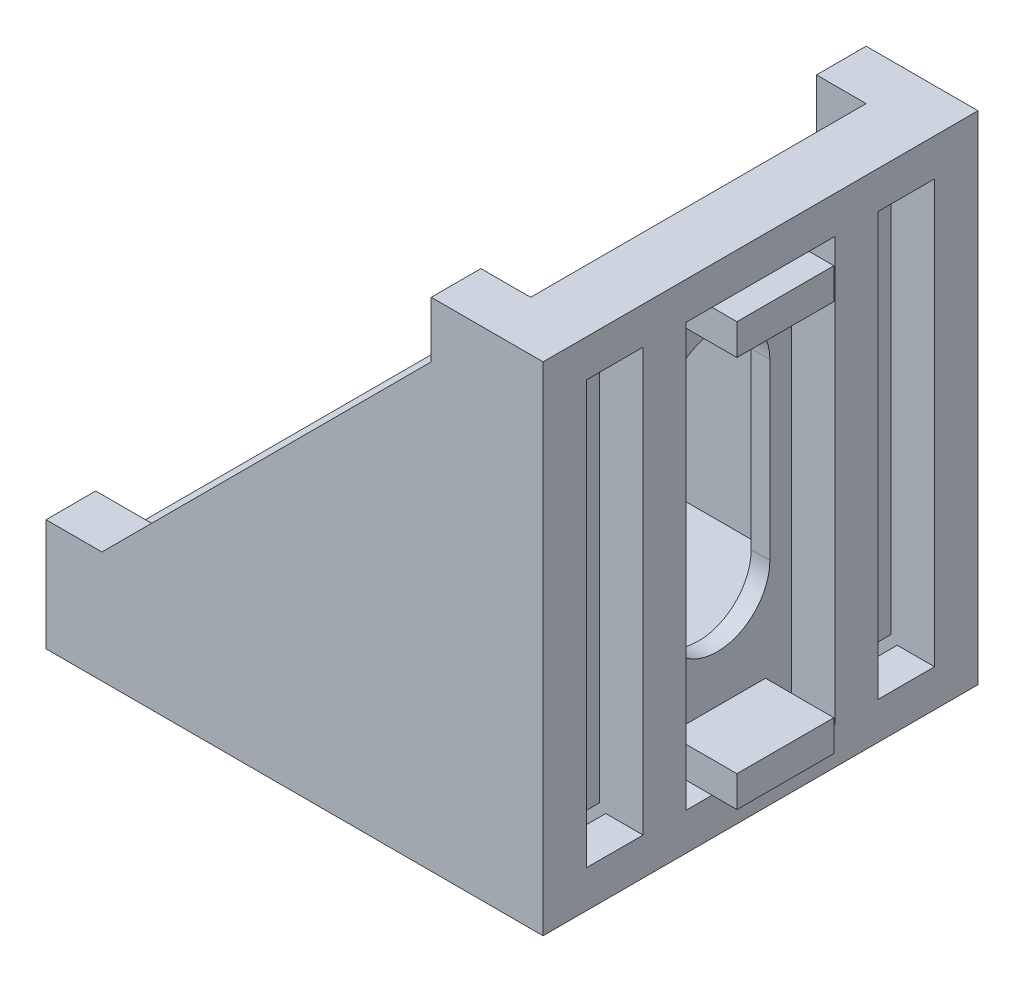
ISO-10303-21;
HEADER;
FILE_DESCRIPTION(('STEP AP214'),'2;1');
FILE_NAME('part.step','',(''),(''),'','','');
FILE_SCHEMA(('AUTOMOTIVE_DESIGN { 1 0 10303 214 1 1 1 1 }'));
ENDSEC;
DATA;
#1=APPLICATION_CONTEXT('core data for automotive mechanical design processes');
#2=APPLICATION_PROTOCOL_DEFINITION('international standard','automotive_design',2000,#1);
#3=PRODUCT_CONTEXT('',#1,'mechanical');
#4=PRODUCT('Part','Part','',(#3));
#5=PRODUCT_RELATED_PRODUCT_CATEGORY('part','',(#4));
#6=PRODUCT_DEFINITION_FORMATION('','',#4);
#7=PRODUCT_DEFINITION_CONTEXT('part definition',#1,'design');
#8=PRODUCT_DEFINITION('design','',#6,#7);
#9=PRODUCT_DEFINITION_SHAPE('','',#8);
#10=(LENGTH_UNIT() NAMED_UNIT(*) SI_UNIT(.MILLI.,.METRE.));
#11=(NAMED_UNIT(*) PLANE_ANGLE_UNIT() SI_UNIT($,.RADIAN.));
#12=(NAMED_UNIT(*) SI_UNIT($,.STERADIAN.) SOLID_ANGLE_UNIT());
#13=UNCERTAINTY_MEASURE_WITH_UNIT(LENGTH_MEASURE(1.E-05),#10,'distance_accuracy_value','');
#14=(GEOMETRIC_REPRESENTATION_CONTEXT(3) GLOBAL_UNCERTAINTY_ASSIGNED_CONTEXT((#13)) GLOBAL_UNIT_ASSIGNED_CONTEXT((#10,
#11,#12)) REPRESENTATION_CONTEXT('',''));
#15=CARTESIAN_POINT('',(0.,0.,0.));
#16=DIRECTION('',(0.,0.,1.));
#17=DIRECTION('',(1.,0.,0.));
#18=AXIS2_PLACEMENT_3D('',#15,#16,#17);
#19=CARTESIAN_POINT('',(17.0000000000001,-16.4999999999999,6.));
#20=DIRECTION('',(-1.,0.,0.));
#21=DIRECTION('',(0.,-1.,0.));
#22=AXIS2_PLACEMENT_3D('',#19,#20,#21);
#23=PLANE('',#22);
#24=DIRECTION('',(0.,1.,0.));
#25=VECTOR('',#24,1.);
#26=CARTESIAN_POINT('',(17.0000000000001,-16.4999999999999,3.9));
#27=LINE('',#26,#25);
#28=CARTESIAN_POINT('',(17.0000000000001,-19.9999999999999,3.9));
#29=VERTEX_POINT('',#28);
#30=CARTESIAN_POINT('',(17.0000000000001,-17.,3.9));
#31=VERTEX_POINT('',#30);
#32=EDGE_CURVE('E11',#29,#31,#27,.T.);
#33=ORIENTED_EDGE('',*,*,#32,.F.);
#34=DIRECTION('',(0.,0.,-1.));
#35=VECTOR('',#34,1.);
#36=CARTESIAN_POINT('',(17.0000000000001,-19.9999999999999,6.));
#37=LINE('',#36,#35);
#38=CARTESIAN_POINT('',(17.0000000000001,-19.9999999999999,6.));
#39=VERTEX_POINT('',#38);
#40=EDGE_CURVE('E548',#39,#29,#37,.T.);
#41=ORIENTED_EDGE('',*,*,#40,.F.);
#42=DIRECTION('',(0.,-1.,0.));
#43=VECTOR('',#42,1.);
#44=CARTESIAN_POINT('',(17.0000000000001,-16.4999999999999,6.));
#45=LINE('',#44,#43);
#46=CARTESIAN_POINT('',(17.0000000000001,-17.,6.));
#47=VERTEX_POINT('',#46);
#48=EDGE_CURVE('E568',#47,#39,#45,.T.);
#49=ORIENTED_EDGE('',*,*,#48,.F.);
#50=DIRECTION('',(0.,0.,-1.));
#51=VECTOR('',#50,1.);
#52=CARTESIAN_POINT('',(17.0000000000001,-17.,6.));
#53=LINE('',#52,#51);
#54=EDGE_CURVE('E583',#47,#31,#53,.T.);
#55=ORIENTED_EDGE('',*,*,#54,.T.);
#56=EDGE_LOOP('',(#33,#41,#49,#55));
#57=FACE_BOUND('',#56,.T.);
#58=ADVANCED_FACE('F34',(#57),#23,.T.);
#59=CARTESIAN_POINT('',(-16.9999999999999,-16.5,6.));
#60=DIRECTION('',(1.,0.,0.));
#61=DIRECTION('',(0.,1.,0.));
#62=AXIS2_PLACEMENT_3D('',#59,#60,#61);
#63=PLANE('',#62);
#64=DIRECTION('',(0.,-1.,0.));
#65=VECTOR('',#64,1.);
#66=CARTESIAN_POINT('',(-16.9999999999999,-16.5,3.9));
#67=LINE('',#66,#65);
#68=CARTESIAN_POINT('',(-16.9999999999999,-16.5,3.9));
#69=VERTEX_POINT('',#68);
#70=CARTESIAN_POINT('',(-16.9999999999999,-20.,3.9));
#71=VERTEX_POINT('',#70);
#72=EDGE_CURVE('E949',#69,#71,#67,.T.);
#73=ORIENTED_EDGE('',*,*,#72,.F.);
#74=DIRECTION('',(0.,0.,1.));
#75=VECTOR('',#74,1.);
#76=CARTESIAN_POINT('',(-16.9999999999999,-16.5,6.));
#77=LINE('',#76,#75);
#78=CARTESIAN_POINT('',(-16.9999999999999,-16.5,6.));
#79=VERTEX_POINT('',#78);
#80=EDGE_CURVE('E547',#69,#79,#77,.T.);
#81=ORIENTED_EDGE('',*,*,#80,.T.);
#82=DIRECTION('',(0.,-1.,0.));
#83=VECTOR('',#82,1.);
#84=CARTESIAN_POINT('',(-16.9999999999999,-16.5,6.));
#85=LINE('',#84,#83);
#86=CARTESIAN_POINT('',(-16.9999999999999,-20.,6.));
#87=VERTEX_POINT('',#86);
#88=EDGE_CURVE('E553',#79,#87,#85,.T.);
#89=ORIENTED_EDGE('',*,*,#88,.T.);
#90=DIRECTION('',(0.,0.,1.));
#91=VECTOR('',#90,1.);
#92=CARTESIAN_POINT('',(-16.9999999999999,-20.,6.));
#93=LINE('',#92,#91);
#94=EDGE_CURVE('E556',#71,#87,#93,.T.);
#95=ORIENTED_EDGE('',*,*,#94,.F.);
#96=EDGE_LOOP('',(#73,#81,#89,#95));
#97=FACE_BOUND('',#96,.T.);
#98=ADVANCED_FACE('F976',(#97),#63,.T.);
#99=CARTESIAN_POINT('',(0.,-15.,0.));
#100=DIRECTION('',(0.,-1.,0.));
#101=DIRECTION('',(1.,0.,0.));
#102=AXIS2_PLACEMENT_3D('',#99,#100,#101);
#103=PLANE('',#102);
#104=DIRECTION('',(-1.,0.,0.));
#105=VECTOR('',#104,1.);
#106=CARTESIAN_POINT('',(-20.,-15.,-13.5));
#107=LINE('',#106,#105);
#108=CARTESIAN_POINT('',(15.,-15.,-13.5));
#109=VERTEX_POINT('',#108);
#110=CARTESIAN_POINT('',(-20.,-15.,-13.5));
#111=VERTEX_POINT('',#110);
#112=EDGE_CURVE('E826',#109,#111,#107,.T.);
#113=ORIENTED_EDGE('',*,*,#112,.T.);
#114=DIRECTION('',(0.,0.,1.));
#115=VECTOR('',#114,1.);
#116=CARTESIAN_POINT('',(-20.,-15.,13.5));
#117=LINE('',#116,#115);
#118=CARTESIAN_POINT('',(-20.,-15.,13.5));
#119=VERTEX_POINT('',#118);
#120=EDGE_CURVE('E829',#111,#119,#117,.T.);
#121=ORIENTED_EDGE('',*,*,#120,.T.);
#122=DIRECTION('',(1.,0.,0.));
#123=VECTOR('',#122,1.);
#124=CARTESIAN_POINT('',(15.,-15.,13.5));
#125=LINE('',#124,#123);
#126=CARTESIAN_POINT('',(15.,-15.,13.5));
#127=VERTEX_POINT('',#126);
#128=EDGE_CURVE('E833',#119,#127,#125,.T.);
#129=ORIENTED_EDGE('',*,*,#128,.T.);
#130=DIRECTION('',(0.,0.,-1.));
#131=VECTOR('',#130,1.);
#132=CARTESIAN_POINT('',(15.,-15.,-13.5));
#133=LINE('',#132,#131);
#134=EDGE_CURVE('E836',#127,#109,#133,.T.);
#135=ORIENTED_EDGE('',*,*,#134,.T.);
#136=EDGE_LOOP('',(#113,#121,#129,#135));
#137=FACE_BOUND('',#136,.T.);
#138=CARTESIAN_POINT('',(-7.53973785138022,-15.,0.));
#139=DIRECTION('',(0.,-1.,0.));
#140=DIRECTION('',(1.,0.,0.));
#141=AXIS2_PLACEMENT_3D('',#138,#139,#140);
#142=CIRCLE('',#141,4.25);
#143=CARTESIAN_POINT('',(-7.53973785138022,-15.,-4.25));
#144=VERTEX_POINT('',#143);
#145=CARTESIAN_POINT('',(-7.53973785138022,-15.,4.25));
#146=VERTEX_POINT('',#145);
#147=EDGE_CURVE('E541',#144,#146,#142,.F.);
#148=ORIENTED_EDGE('',*,*,#147,.F.);
#149=DIRECTION('',(-1.,0.,0.));
#150=VECTOR('',#149,1.);
#151=CARTESIAN_POINT('',(0.,-15.,-4.25));
#152=LINE('',#151,#150);
#153=CARTESIAN_POINT('',(6.46026214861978,-15.,-4.25));
#154=VERTEX_POINT('',#153);
#155=EDGE_CURVE('E528',#154,#144,#152,.T.);
#156=ORIENTED_EDGE('',*,*,#155,.F.);
#157=CARTESIAN_POINT('',(6.46026214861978,-15.,0.));
#158=DIRECTION('',(0.,-1.,0.));
#159=DIRECTION('',(1.,0.,0.));
#160=AXIS2_PLACEMENT_3D('',#157,#158,#159);
#161=CIRCLE('',#160,4.25);
#162=CARTESIAN_POINT('',(6.46026214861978,-15.,4.25));
#163=VERTEX_POINT('',#162);
#164=EDGE_CURVE('E536',#163,#154,#161,.F.);
#165=ORIENTED_EDGE('',*,*,#164,.F.);
#166=DIRECTION('',(1.,0.,0.));
#167=VECTOR('',#166,1.);
#168=CARTESIAN_POINT('',(0.,-15.,4.25));
#169=LINE('',#168,#167);
#170=EDGE_CURVE('E539',#146,#163,#169,.T.);
#171=ORIENTED_EDGE('',*,*,#170,.F.);
#172=EDGE_LOOP('',(#148,#156,#165,#171));
#173=FACE_BOUND('',#172,.T.);
#174=ADVANCED_FACE('F1019',(#137,#173),#103,.F.);
#175=CARTESIAN_POINT('',(0.,-16.5,0.));
#176=DIRECTION('',(0.,-1.,0.));
#177=DIRECTION('',(-1.,0.,0.));
#178=AXIS2_PLACEMENT_3D('',#175,#176,#177);
#179=PLANE('',#178);
#180=DIRECTION('',(1.,0.,0.));
#181=VECTOR('',#180,1.);
#182=CARTESIAN_POINT('',(17.,-16.4999999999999,3.9));
#183=LINE('',#182,#181);
#184=CARTESIAN_POINT('',(14.5,-16.5,3.9));
#185=VERTEX_POINT('',#184);
#186=CARTESIAN_POINT('',(16.5,-16.4999999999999,3.9));
#187=VERTEX_POINT('',#186);
#188=EDGE_CURVE('E453',#185,#187,#183,.T.);
#189=ORIENTED_EDGE('',*,*,#188,.T.);
#190=DIRECTION('',(0.,0.,-1.));
#191=VECTOR('',#190,1.);
#192=CARTESIAN_POINT('',(16.5,-16.4999999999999,0.));
#193=LINE('',#192,#191);
#194=CARTESIAN_POINT('',(16.5,-16.4999999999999,6.));
#195=VERTEX_POINT('',#194);
#196=EDGE_CURVE('E580',#195,#187,#193,.T.);
#197=ORIENTED_EDGE('',*,*,#196,.F.);
#198=DIRECTION('',(1.,0.,0.));
#199=VECTOR('',#198,1.);
#200=CARTESIAN_POINT('',(-16.9999999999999,-16.5,6.));
#201=LINE('',#200,#199);
#202=EDGE_CURVE('E544',#79,#195,#201,.T.);
#203=ORIENTED_EDGE('',*,*,#202,.F.);
#204=ORIENTED_EDGE('',*,*,#80,.F.);
#205=DIRECTION('',(1.,0.,0.));
#206=VECTOR('',#205,1.);
#207=CARTESIAN_POINT('',(-16.9999999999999,-16.5,3.9));
#208=LINE('',#207,#206);
#209=CARTESIAN_POINT('',(-14.4999999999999,-16.5,3.9));
#210=VERTEX_POINT('',#209);
#211=EDGE_CURVE('E456',#69,#210,#208,.T.);
#212=ORIENTED_EDGE('',*,*,#211,.T.);
#213=DIRECTION('',(0.,0.,-1.));
#214=VECTOR('',#213,1.);
#215=CARTESIAN_POINT('',(-14.4999999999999,-16.5,3.9));
#216=LINE('',#215,#214);
#217=CARTESIAN_POINT('',(-14.4999999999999,-16.5,-3.9));
#218=VERTEX_POINT('',#217);
#219=EDGE_CURVE('E487',#210,#218,#216,.T.);
#220=ORIENTED_EDGE('',*,*,#219,.T.);
#221=DIRECTION('',(-1.,0.,0.));
#222=VECTOR('',#221,1.);
#223=CARTESIAN_POINT('',(-16.9999999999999,-16.5,-3.9));
#224=LINE('',#223,#222);
#225=CARTESIAN_POINT('',(-16.9999999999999,-16.5,-3.9));
#226=VERTEX_POINT('',#225);
#227=EDGE_CURVE('E498',#218,#226,#224,.T.);
#228=ORIENTED_EDGE('',*,*,#227,.T.);
#229=CARTESIAN_POINT('',(-16.9999999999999,-16.5,-6.));
#230=VERTEX_POINT('',#229);
#231=EDGE_CURVE('E549',#230,#226,#77,.T.);
#232=ORIENTED_EDGE('',*,*,#231,.F.);
#233=DIRECTION('',(-1.,0.,0.));
#234=VECTOR('',#233,1.);
#235=CARTESIAN_POINT('',(-16.9999999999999,-16.5,-6.));
#236=LINE('',#235,#234);
#237=CARTESIAN_POINT('',(16.5,-16.4999999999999,-6.));
#238=VERTEX_POINT('',#237);
#239=EDGE_CURVE('E551',#238,#230,#236,.T.);
#240=ORIENTED_EDGE('',*,*,#239,.F.);
#241=CARTESIAN_POINT('',(16.5,-16.4999999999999,-3.9));
#242=VERTEX_POINT('',#241);
#243=EDGE_CURVE('E570',#242,#238,#193,.T.);
#244=ORIENTED_EDGE('',*,*,#243,.F.);
#245=DIRECTION('',(-1.,0.,0.));
#246=VECTOR('',#245,1.);
#247=CARTESIAN_POINT('',(17.,-16.4999999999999,-3.9));
#248=LINE('',#247,#246);
#249=CARTESIAN_POINT('',(14.5,-16.5,-3.9));
#250=VERTEX_POINT('',#249);
#251=EDGE_CURVE('E54',#242,#250,#248,.T.);
#252=ORIENTED_EDGE('',*,*,#251,.T.);
#253=DIRECTION('',(0.,0.,1.));
#254=VECTOR('',#253,1.);
#255=CARTESIAN_POINT('',(14.5,-16.5,3.9));
#256=LINE('',#255,#254);
#257=EDGE_CURVE('E49',#250,#185,#256,.T.);
#258=ORIENTED_EDGE('',*,*,#257,.T.);
#259=EDGE_LOOP('',(#189,#197,#203,#204,#212,#220,#228,#232,#240,#244,#252,#258));
#260=FACE_BOUND('',#259,.T.);
#261=DIRECTION('',(-1.,0.,0.));
#262=VECTOR('',#261,1.);
#263=CARTESIAN_POINT('',(-7.53973785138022,-16.5,-4.25));
#264=LINE('',#263,#262);
#265=CARTESIAN_POINT('',(6.46026214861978,-16.5,-4.25));
#266=VERTEX_POINT('',#265);
#267=CARTESIAN_POINT('',(-7.53973785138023,-16.5,-4.25));
#268=VERTEX_POINT('',#267);
#269=EDGE_CURVE('E516',#266,#268,#264,.T.);
#270=ORIENTED_EDGE('',*,*,#269,.T.);
#271=CARTESIAN_POINT('',(-7.53973785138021,-16.5,0.));
#272=DIRECTION('',(0.,1.,0.));
#273=DIRECTION('',(-1.,0.,0.));
#274=AXIS2_PLACEMENT_3D('',#271,#272,#273);
#275=CIRCLE('',#274,4.25);
#276=CARTESIAN_POINT('',(-7.53973785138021,-16.5,4.25));
#277=VERTEX_POINT('',#276);
#278=EDGE_CURVE('E513',#268,#277,#275,.T.);
#279=ORIENTED_EDGE('',*,*,#278,.T.);
#280=DIRECTION('',(1.,0.,0.));
#281=VECTOR('',#280,1.);
#282=CARTESIAN_POINT('',(-7.53973785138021,-16.5,4.25));
#283=LINE('',#282,#281);
#284=CARTESIAN_POINT('',(6.46026214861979,-16.5,4.25));
#285=VERTEX_POINT('',#284);
#286=EDGE_CURVE('E522',#277,#285,#283,.T.);
#287=ORIENTED_EDGE('',*,*,#286,.T.);
#288=CARTESIAN_POINT('',(6.46026214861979,-16.5,0.));
#289=DIRECTION('',(0.,1.,0.));
#290=DIRECTION('',(-1.,0.,0.));
#291=AXIS2_PLACEMENT_3D('',#288,#289,#290);
#292=CIRCLE('',#291,4.25);
#293=EDGE_CURVE('E519',#285,#266,#292,.T.);
#294=ORIENTED_EDGE('',*,*,#293,.T.);
#295=EDGE_LOOP('',(#270,#279,#287,#294));
#296=FACE_BOUND('',#295,.T.);
#297=ADVANCED_FACE('F979',(#260,#296),#179,.T.);
#298=CARTESIAN_POINT('',(-20.,-20.,17.5));
#299=DIRECTION('',(0.,1.,0.));
#300=DIRECTION('',(-1.,0.,0.));
#301=AXIS2_PLACEMENT_3D('',#298,#299,#300);
#302=PLANE('',#301);
#303=DIRECTION('',(0.,0.,1.));
#304=VECTOR('',#303,1.);
#305=CARTESIAN_POINT('',(-16.9999999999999,-20.,-14.));
#306=LINE('',#305,#304);
#307=CARTESIAN_POINT('',(-16.9999999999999,-20.,-14.));
#308=VERTEX_POINT('',#307);
#309=CARTESIAN_POINT('',(-16.9999999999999,-20.,-9.4523835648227));
#310=VERTEX_POINT('',#309);
#311=EDGE_CURVE('E585',#308,#310,#306,.T.);
#312=ORIENTED_EDGE('',*,*,#311,.T.);
#313=DIRECTION('',(1.,0.,0.));
#314=VECTOR('',#313,1.);
#315=CARTESIAN_POINT('',(-16.9999999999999,-20.,-9.4523835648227));
#316=LINE('',#315,#314);
#317=CARTESIAN_POINT('',(17.0000000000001,-19.9999999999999,-9.4523835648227));
#318=VERTEX_POINT('',#317);
#319=EDGE_CURVE('E590',#310,#318,#316,.T.);
#320=ORIENTED_EDGE('',*,*,#319,.T.);
#321=DIRECTION('',(0.,0.,-1.));
#322=VECTOR('',#321,1.);
#323=CARTESIAN_POINT('',(17.0000000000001,-19.9999999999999,-14.));
#324=LINE('',#323,#322);
#325=CARTESIAN_POINT('',(17.0000000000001,-19.9999999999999,-14.));
#326=VERTEX_POINT('',#325);
#327=EDGE_CURVE('E601',#318,#326,#324,.T.);
#328=ORIENTED_EDGE('',*,*,#327,.T.);
#329=DIRECTION('',(-1.,0.,0.));
#330=VECTOR('',#329,1.);
#331=CARTESIAN_POINT('',(-16.9999999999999,-20.,-14.));
#332=LINE('',#331,#330);
#333=EDGE_CURVE('E598',#326,#308,#332,.T.);
#334=ORIENTED_EDGE('',*,*,#333,.T.);
#335=EDGE_LOOP('',(#312,#320,#328,#334));
#336=FACE_BOUND('',#335,.T.);
#337=DIRECTION('',(1.,0.,0.));
#338=VECTOR('',#337,1.);
#339=CARTESIAN_POINT('',(-20.,-20.,-17.5));
#340=LINE('',#339,#338);
#341=CARTESIAN_POINT('',(-20.,-20.,-17.5));
#342=VERTEX_POINT('',#341);
#343=CARTESIAN_POINT('',(20.,-20.,-17.5));
#344=VERTEX_POINT('',#343);
#345=EDGE_CURVE('E913',#342,#344,#340,.T.);
#346=ORIENTED_EDGE('',*,*,#345,.T.);
#347=DIRECTION('',(0.,0.,-1.));
#348=VECTOR('',#347,1.);
#349=CARTESIAN_POINT('',(20.,-20.,17.5));
#350=LINE('',#349,#348);
#351=CARTESIAN_POINT('',(20.,-20.,17.5));
#352=VERTEX_POINT('',#351);
#353=EDGE_CURVE('E921',#352,#344,#350,.T.);
#354=ORIENTED_EDGE('',*,*,#353,.F.);
#355=DIRECTION('',(1.,0.,0.));
#356=VECTOR('',#355,1.);
#357=CARTESIAN_POINT('',(-20.,-20.,17.5));
#358=LINE('',#357,#356);
#359=CARTESIAN_POINT('',(-20.,-20.,17.5));
#360=VERTEX_POINT('',#359);
#361=EDGE_CURVE('E903',#360,#352,#358,.T.);
#362=ORIENTED_EDGE('',*,*,#361,.F.);
#363=DIRECTION('',(0.,0.,-1.));
#364=VECTOR('',#363,1.);
#365=CARTESIAN_POINT('',(-20.,-20.,17.5));
#366=LINE('',#365,#364);
#367=EDGE_CURVE('E924',#360,#342,#366,.T.);
#368=ORIENTED_EDGE('',*,*,#367,.T.);
#369=EDGE_LOOP('',(#346,#354,#362,#368));
#370=FACE_BOUND('',#369,.T.);
#371=DIRECTION('',(1.,0.,0.));
#372=VECTOR('',#371,1.);
#373=CARTESIAN_POINT('',(-16.9999999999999,-20.,14.));
#374=LINE('',#373,#372);
#375=CARTESIAN_POINT('',(-16.9999999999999,-20.,14.));
#376=VERTEX_POINT('',#375);
#377=CARTESIAN_POINT('',(17.0000000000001,-19.9999999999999,14.));
#378=VERTEX_POINT('',#377);
#379=EDGE_CURVE('E617',#376,#378,#374,.T.);
#380=ORIENTED_EDGE('',*,*,#379,.T.);
#381=DIRECTION('',(0.,0.,-1.));
#382=VECTOR('',#381,1.);
#383=CARTESIAN_POINT('',(17.0000000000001,-19.9999999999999,14.));
#384=LINE('',#383,#382);
#385=CARTESIAN_POINT('',(17.0000000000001,-19.9999999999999,9.4523835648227));
#386=VERTEX_POINT('',#385);
#387=EDGE_CURVE('E622',#378,#386,#384,.T.);
#388=ORIENTED_EDGE('',*,*,#387,.T.);
#389=DIRECTION('',(-1.,0.,0.));
#390=VECTOR('',#389,1.);
#391=CARTESIAN_POINT('',(-16.9999999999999,-20.,9.4523835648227));
#392=LINE('',#391,#390);
#393=CARTESIAN_POINT('',(-16.9999999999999,-20.,9.4523835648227));
#394=VERTEX_POINT('',#393);
#395=EDGE_CURVE('E632',#386,#394,#392,.T.);
#396=ORIENTED_EDGE('',*,*,#395,.T.);
#397=DIRECTION('',(0.,0.,1.));
#398=VECTOR('',#397,1.);
#399=CARTESIAN_POINT('',(-16.9999999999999,-20.,14.));
#400=LINE('',#399,#398);
#401=EDGE_CURVE('E629',#394,#376,#400,.T.);
#402=ORIENTED_EDGE('',*,*,#401,.T.);
#403=EDGE_LOOP('',(#380,#388,#396,#402));
#404=FACE_BOUND('',#403,.T.);
#405=DIRECTION('',(1.,0.,0.));
#406=VECTOR('',#405,1.);
#407=CARTESIAN_POINT('',(-16.9999999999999,-20.,6.));
#408=LINE('',#407,#406);
#409=EDGE_CURVE('E543',#87,#39,#408,.T.);
#410=ORIENTED_EDGE('',*,*,#409,.T.);
#411=ORIENTED_EDGE('',*,*,#40,.T.);
#412=CARTESIAN_POINT('',(17.0000000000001,-19.9999999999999,-3.9));
#413=VERTEX_POINT('',#412);
#414=EDGE_CURVE('E567',#29,#413,#37,.T.);
#415=ORIENTED_EDGE('',*,*,#414,.T.);
#416=CARTESIAN_POINT('',(17.0000000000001,-19.9999999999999,-6.));
#417=VERTEX_POINT('',#416);
#418=EDGE_CURVE('E564',#413,#417,#37,.T.);
#419=ORIENTED_EDGE('',*,*,#418,.T.);
#420=DIRECTION('',(-1.,0.,0.));
#421=VECTOR('',#420,1.);
#422=CARTESIAN_POINT('',(-16.9999999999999,-20.,-6.));
#423=LINE('',#422,#421);
#424=CARTESIAN_POINT('',(-16.9999999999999,-20.,-6.));
#425=VERTEX_POINT('',#424);
#426=EDGE_CURVE('E560',#417,#425,#423,.T.);
#427=ORIENTED_EDGE('',*,*,#426,.T.);
#428=CARTESIAN_POINT('',(-16.9999999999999,-20.,-3.9));
#429=VERTEX_POINT('',#428);
#430=EDGE_CURVE('E557',#425,#429,#93,.T.);
#431=ORIENTED_EDGE('',*,*,#430,.T.);
#432=EDGE_CURVE('E561',#429,#71,#93,.T.);
#433=ORIENTED_EDGE('',*,*,#432,.T.);
#434=ORIENTED_EDGE('',*,*,#94,.T.);
#435=EDGE_LOOP('',(#410,#411,#415,#419,#427,#431,#433,#434));
#436=FACE_BOUND('',#435,.T.);
#437=ADVANCED_FACE('F967',(#336,#370,#404,#436),#302,.F.);
#438=CARTESIAN_POINT('',(16.5,0.,0.));
#439=DIRECTION('',(1.,0.,0.));
#440=DIRECTION('',(0.,1.,0.));
#441=AXIS2_PLACEMENT_3D('',#438,#439,#440);
#442=PLANE('',#441);
#443=CARTESIAN_POINT('',(16.5,7.53973785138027,0.));
#444=DIRECTION('',(1.,0.,0.));
#445=DIRECTION('',(0.,1.,0.));
#446=AXIS2_PLACEMENT_3D('',#443,#444,#445);
#447=CIRCLE('',#446,4.25);
#448=CARTESIAN_POINT('',(16.5,7.53973785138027,-4.25));
#449=VERTEX_POINT('',#448);
#450=CARTESIAN_POINT('',(16.5,7.53973785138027,4.25));
#451=VERTEX_POINT('',#450);
#452=EDGE_CURVE('E704',#449,#451,#447,.T.);
#453=ORIENTED_EDGE('',*,*,#452,.F.);
#454=DIRECTION('',(0.,1.,0.));
#455=VECTOR('',#454,1.);
#456=CARTESIAN_POINT('',(16.5,7.53973785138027,-4.25));
#457=LINE('',#456,#455);
#458=CARTESIAN_POINT('',(16.5,-6.46026214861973,-4.25));
#459=VERTEX_POINT('',#458);
#460=EDGE_CURVE('E712',#459,#449,#457,.T.);
#461=ORIENTED_EDGE('',*,*,#460,.F.);
#462=CARTESIAN_POINT('',(16.5,-6.46026214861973,0.));
#463=DIRECTION('',(1.,0.,0.));
#464=DIRECTION('',(0.,1.,0.));
#465=AXIS2_PLACEMENT_3D('',#462,#463,#464);
#466=CIRCLE('',#465,4.25);
#467=CARTESIAN_POINT('',(16.5,-6.46026214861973,4.25));
#468=VERTEX_POINT('',#467);
#469=EDGE_CURVE('E709',#468,#459,#466,.T.);
#470=ORIENTED_EDGE('',*,*,#469,.F.);
#471=DIRECTION('',(0.,-1.,0.));
#472=VECTOR('',#471,1.);
#473=CARTESIAN_POINT('',(16.5,7.53973785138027,4.25));
#474=LINE('',#473,#472);
#475=EDGE_CURVE('E706',#451,#468,#474,.T.);
#476=ORIENTED_EDGE('',*,*,#475,.F.);
#477=EDGE_LOOP('',(#453,#461,#470,#476));
#478=FACE_BOUND('',#477,.T.);
#479=DIRECTION('',(0.,-1.,0.));
#480=VECTOR('',#479,1.);
#481=CARTESIAN_POINT('',(16.5,17.,6.));
#482=LINE('',#481,#480);
#483=CARTESIAN_POINT('',(16.5,17.,6.));
#484=VERTEX_POINT('',#483);
#485=EDGE_CURVE('E737',#484,#195,#482,.T.);
#486=ORIENTED_EDGE('',*,*,#485,.T.);
#487=ORIENTED_EDGE('',*,*,#196,.T.);
#488=DIRECTION('',(0.,-1.,0.));
#489=VECTOR('',#488,1.);
#490=CARTESIAN_POINT('',(16.5,-17.,3.9));
#491=LINE('',#490,#489);
#492=CARTESIAN_POINT('',(16.5,-14.5,3.9));
#493=VERTEX_POINT('',#492);
#494=EDGE_CURVE('E639',#493,#187,#491,.T.);
#495=ORIENTED_EDGE('',*,*,#494,.F.);
#496=DIRECTION('',(0.,0.,1.));
#497=VECTOR('',#496,1.);
#498=CARTESIAN_POINT('',(16.5,-14.5,3.9));
#499=LINE('',#498,#497);
#500=CARTESIAN_POINT('',(16.5,-14.5,-3.9));
#501=VERTEX_POINT('',#500);
#502=EDGE_CURVE('E650',#501,#493,#499,.T.);
#503=ORIENTED_EDGE('',*,*,#502,.F.);
#504=DIRECTION('',(0.,1.,0.));
#505=VECTOR('',#504,1.);
#506=CARTESIAN_POINT('',(16.5,-17.,-3.9));
#507=LINE('',#506,#505);
#508=EDGE_CURVE('E658',#242,#501,#507,.T.);
#509=ORIENTED_EDGE('',*,*,#508,.F.);
#510=ORIENTED_EDGE('',*,*,#243,.T.);
#511=DIRECTION('',(0.,1.,0.));
#512=VECTOR('',#511,1.);
#513=CARTESIAN_POINT('',(16.5,17.,-6.));
#514=LINE('',#513,#512);
#515=CARTESIAN_POINT('',(16.5,17.,-6.));
#516=VERTEX_POINT('',#515);
#517=EDGE_CURVE('E740',#238,#516,#514,.T.);
#518=ORIENTED_EDGE('',*,*,#517,.T.);
#519=DIRECTION('',(0.,0.,1.));
#520=VECTOR('',#519,1.);
#521=CARTESIAN_POINT('',(16.5,17.,6.));
#522=LINE('',#521,#520);
#523=CARTESIAN_POINT('',(16.5,17.,-3.9));
#524=VERTEX_POINT('',#523);
#525=EDGE_CURVE('E744',#516,#524,#522,.T.);
#526=ORIENTED_EDGE('',*,*,#525,.T.);
#527=DIRECTION('',(0.,1.,0.));
#528=VECTOR('',#527,1.);
#529=CARTESIAN_POINT('',(16.5,17.,-3.9));
#530=LINE('',#529,#528);
#531=CARTESIAN_POINT('',(16.5,14.5,-3.9));
#532=VERTEX_POINT('',#531);
#533=EDGE_CURVE('E678',#532,#524,#530,.T.);
#534=ORIENTED_EDGE('',*,*,#533,.F.);
#535=DIRECTION('',(0.,0.,-1.));
#536=VECTOR('',#535,1.);
#537=CARTESIAN_POINT('',(16.5,14.5,3.9));
#538=LINE('',#537,#536);
#539=CARTESIAN_POINT('',(16.5,14.5,3.9));
#540=VERTEX_POINT('',#539);
#541=EDGE_CURVE('E687',#540,#532,#538,.T.);
#542=ORIENTED_EDGE('',*,*,#541,.F.);
#543=DIRECTION('',(0.,-1.,0.));
#544=VECTOR('',#543,1.);
#545=CARTESIAN_POINT('',(16.5,17.,3.9));
#546=LINE('',#545,#544);
#547=CARTESIAN_POINT('',(16.5,17.,3.9));
#548=VERTEX_POINT('',#547);
#549=EDGE_CURVE('E673',#548,#540,#546,.T.);
#550=ORIENTED_EDGE('',*,*,#549,.F.);
#551=EDGE_CURVE('E743',#548,#484,#522,.T.);
#552=ORIENTED_EDGE('',*,*,#551,.T.);
#553=EDGE_LOOP('',(#486,#487,#495,#503,#509,#510,#518,#526,#534,#542,#550,#552));
#554=FACE_BOUND('',#553,.T.);
#555=ADVANCED_FACE('F1109',(#478,#554),#442,.T.);
#556=CARTESIAN_POINT('',(16.5,-17.,6.));
#557=DIRECTION('',(0.,-1.,0.));
#558=DIRECTION('',(1.,0.,0.));
#559=AXIS2_PLACEMENT_3D('',#556,#557,#558);
#560=PLANE('',#559);
#561=ORIENTED_EDGE('',*,*,#54,.F.);
#562=DIRECTION('',(1.,0.,0.));
#563=VECTOR('',#562,1.);
#564=CARTESIAN_POINT('',(16.5,-17.,6.));
#565=LINE('',#564,#563);
#566=CARTESIAN_POINT('',(20.,-17.,6.));
#567=VERTEX_POINT('',#566);
#568=EDGE_CURVE('E747',#47,#567,#565,.T.);
#569=ORIENTED_EDGE('',*,*,#568,.T.);
#570=DIRECTION('',(0.,0.,-1.));
#571=VECTOR('',#570,1.);
#572=CARTESIAN_POINT('',(20.,-17.,6.));
#573=LINE('',#572,#571);
#574=CARTESIAN_POINT('',(20.,-17.,3.9));
#575=VERTEX_POINT('',#574);
#576=EDGE_CURVE('E751',#567,#575,#573,.T.);
#577=ORIENTED_EDGE('',*,*,#576,.T.);
#578=DIRECTION('',(1.,0.,0.));
#579=VECTOR('',#578,1.);
#580=CARTESIAN_POINT('',(16.5,-17.,3.9));
#581=LINE('',#580,#579);
#582=EDGE_CURVE('E936',#31,#575,#581,.T.);
#583=ORIENTED_EDGE('',*,*,#582,.F.);
#584=EDGE_LOOP('',(#561,#569,#577,#583));
#585=FACE_BOUND('',#584,.T.);
#586=ADVANCED_FACE('F1112',(#585),#560,.F.);
#587=DIRECTION('',(0.,0.,-1.));
#588=VECTOR('',#587,1.);
#589=CARTESIAN_POINT('',(17.0000000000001,-17.,6.));
#590=LINE('',#589,#588);
#591=CARTESIAN_POINT('',(17.0000000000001,-17.,-3.9));
#592=VERTEX_POINT('',#591);
#593=CARTESIAN_POINT('',(17.0000000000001,-17.,-6.));
#594=VERTEX_POINT('',#593);
#595=EDGE_CURVE('E581',#592,#594,#590,.T.);
#596=ORIENTED_EDGE('',*,*,#595,.F.);
#597=DIRECTION('',(-1.,0.,0.));
#598=VECTOR('',#597,1.);
#599=CARTESIAN_POINT('',(16.5,-17.,-3.9));
#600=LINE('',#599,#598);
#601=CARTESIAN_POINT('',(20.,-17.,-3.9));
#602=VERTEX_POINT('',#601);
#603=EDGE_CURVE('E933',#602,#592,#600,.T.);
#604=ORIENTED_EDGE('',*,*,#603,.F.);
#605=CARTESIAN_POINT('',(20.,-17.,-6.));
#606=VERTEX_POINT('',#605);
#607=EDGE_CURVE('E750',#602,#606,#573,.T.);
#608=ORIENTED_EDGE('',*,*,#607,.T.);
#609=DIRECTION('',(1.,0.,0.));
#610=VECTOR('',#609,1.);
#611=CARTESIAN_POINT('',(16.5,-17.,-6.));
#612=LINE('',#611,#610);
#613=EDGE_CURVE('E767',#594,#606,#612,.T.);
#614=ORIENTED_EDGE('',*,*,#613,.F.);
#615=EDGE_LOOP('',(#596,#604,#608,#614));
#616=FACE_BOUND('',#615,.T.);
#617=ADVANCED_FACE('F1072',(#616),#560,.F.);
#618=CARTESIAN_POINT('',(22.,-17.,3.9));
#619=DIRECTION('',(0.,0.,-1.));
#620=DIRECTION('',(-1.,0.,0.));
#621=AXIS2_PLACEMENT_3D('',#618,#619,#620);
#622=PLANE('',#621);
#623=ORIENTED_EDGE('',*,*,#494,.T.);
#624=ORIENTED_EDGE('',*,*,#188,.F.);
#625=DIRECTION('',(0.,1.,0.));
#626=VECTOR('',#625,1.);
#627=CARTESIAN_POINT('',(14.5000000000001,-22.,3.9));
#628=LINE('',#627,#626);
#629=CARTESIAN_POINT('',(14.5000000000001,-22.,3.9));
#630=VERTEX_POINT('',#629);
#631=EDGE_CURVE('E446',#630,#185,#628,.T.);
#632=ORIENTED_EDGE('',*,*,#631,.F.);
#633=DIRECTION('',(1.,0.,0.));
#634=VECTOR('',#633,1.);
#635=CARTESIAN_POINT('',(17.0000000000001,-21.9999999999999,3.9));
#636=LINE('',#635,#634);
#637=CARTESIAN_POINT('',(17.0000000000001,-21.9999999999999,3.9));
#638=VERTEX_POINT('',#637);
#639=EDGE_CURVE('E451',#630,#638,#636,.T.);
#640=ORIENTED_EDGE('',*,*,#639,.T.);
#641=DIRECTION('',(0.,1.,0.));
#642=VECTOR('',#641,1.);
#643=CARTESIAN_POINT('',(17.0000000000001,-21.9999999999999,3.9));
#644=LINE('',#643,#642);
#645=EDGE_CURVE('E474',#638,#29,#644,.T.);
#646=ORIENTED_EDGE('',*,*,#645,.T.);
#647=ORIENTED_EDGE('',*,*,#32,.T.);
#648=ORIENTED_EDGE('',*,*,#582,.T.);
#649=DIRECTION('',(-1.,0.,0.));
#650=VECTOR('',#649,1.);
#651=CARTESIAN_POINT('',(22.,-17.,3.9));
#652=LINE('',#651,#650);
#653=CARTESIAN_POINT('',(22.,-17.,3.9));
#654=VERTEX_POINT('',#653);
#655=EDGE_CURVE('E670',#654,#575,#652,.T.);
#656=ORIENTED_EDGE('',*,*,#655,.F.);
#657=DIRECTION('',(0.,-1.,0.));
#658=VECTOR('',#657,1.);
#659=CARTESIAN_POINT('',(22.,-17.,3.9));
#660=LINE('',#659,#658);
#661=CARTESIAN_POINT('',(22.,-14.5,3.9));
#662=VERTEX_POINT('',#661);
#663=EDGE_CURVE('E646',#662,#654,#660,.T.);
#664=ORIENTED_EDGE('',*,*,#663,.F.);
#665=DIRECTION('',(-1.,0.,0.));
#666=VECTOR('',#665,1.);
#667=CARTESIAN_POINT('',(22.,-14.5,3.9));
#668=LINE('',#667,#666);
#669=EDGE_CURVE('E656',#662,#493,#668,.T.);
#670=ORIENTED_EDGE('',*,*,#669,.T.);
#671=EDGE_LOOP('',(#623,#624,#632,#640,#646,#647,#648,#656,#664,#670));
#672=FACE_BOUND('',#671,.T.);
#673=ADVANCED_FACE('F449',(#672),#622,.F.);
#674=CARTESIAN_POINT('',(22.,-17.,-3.9));
#675=DIRECTION('',(0.,0.,1.));
#676=DIRECTION('',(1.,0.,0.));
#677=AXIS2_PLACEMENT_3D('',#674,#675,#676);
#678=PLANE('',#677);
#679=ORIENTED_EDGE('',*,*,#603,.T.);
#680=DIRECTION('',(0.,-1.,0.));
#681=VECTOR('',#680,1.);
#682=CARTESIAN_POINT('',(17.0000000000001,-16.4999999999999,-3.9));
#683=LINE('',#682,#681);
#684=EDGE_CURVE('E42',#592,#413,#683,.T.);
#685=ORIENTED_EDGE('',*,*,#684,.T.);
#686=DIRECTION('',(0.,1.,0.));
#687=VECTOR('',#686,1.);
#688=CARTESIAN_POINT('',(17.0000000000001,-21.9999999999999,-3.9));
#689=LINE('',#688,#687);
#690=CARTESIAN_POINT('',(17.0000000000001,-21.9999999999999,-3.9));
#691=VERTEX_POINT('',#690);
#692=EDGE_CURVE('E479',#691,#413,#689,.T.);
#693=ORIENTED_EDGE('',*,*,#692,.F.);
#694=DIRECTION('',(-1.,0.,0.));
#695=VECTOR('',#694,1.);
#696=CARTESIAN_POINT('',(17.0000000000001,-21.9999999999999,-3.9));
#697=LINE('',#696,#695);
#698=CARTESIAN_POINT('',(14.5000000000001,-22.,-3.9));
#699=VERTEX_POINT('',#698);
#700=EDGE_CURVE('E469',#691,#699,#697,.T.);
#701=ORIENTED_EDGE('',*,*,#700,.T.);
#702=DIRECTION('',(0.,1.,0.));
#703=VECTOR('',#702,1.);
#704=CARTESIAN_POINT('',(14.5000000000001,-22.,-3.9));
#705=LINE('',#704,#703);
#706=EDGE_CURVE('E457',#699,#250,#705,.T.);
#707=ORIENTED_EDGE('',*,*,#706,.T.);
#708=ORIENTED_EDGE('',*,*,#251,.F.);
#709=ORIENTED_EDGE('',*,*,#508,.T.);
#710=DIRECTION('',(-1.,0.,0.));
#711=VECTOR('',#710,1.);
#712=CARTESIAN_POINT('',(22.,-14.5,-3.9));
#713=LINE('',#712,#711);
#714=CARTESIAN_POINT('',(22.,-14.5,-3.9));
#715=VERTEX_POINT('',#714);
#716=EDGE_CURVE('E664',#715,#501,#713,.T.);
#717=ORIENTED_EDGE('',*,*,#716,.F.);
#718=DIRECTION('',(0.,1.,0.));
#719=VECTOR('',#718,1.);
#720=CARTESIAN_POINT('',(22.,-17.,-3.9));
#721=LINE('',#720,#719);
#722=CARTESIAN_POINT('',(22.,-17.,-3.9));
#723=VERTEX_POINT('',#722);
#724=EDGE_CURVE('E652',#723,#715,#721,.T.);
#725=ORIENTED_EDGE('',*,*,#724,.F.);
#726=DIRECTION('',(-1.,0.,0.));
#727=VECTOR('',#726,1.);
#728=CARTESIAN_POINT('',(22.,-17.,-3.9));
#729=LINE('',#728,#727);
#730=EDGE_CURVE('E667',#723,#602,#729,.T.);
#731=ORIENTED_EDGE('',*,*,#730,.T.);
#732=EDGE_LOOP('',(#679,#685,#693,#701,#707,#708,#709,#717,#725,#731));
#733=FACE_BOUND('',#732,.T.);
#734=ADVANCED_FACE('F953',(#733),#678,.F.);
#735=CARTESIAN_POINT('',(16.5,-17.,-14.));
#736=DIRECTION('',(0.,-1.,0.));
#737=DIRECTION('',(1.,0.,0.));
#738=AXIS2_PLACEMENT_3D('',#735,#736,#737);
#739=PLANE('',#738);
#740=DIRECTION('',(0.,0.,-1.));
#741=VECTOR('',#740,1.);
#742=CARTESIAN_POINT('',(17.0000000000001,-17.,-14.));
#743=LINE('',#742,#741);
#744=CARTESIAN_POINT('',(17.0000000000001,-17.,-9.4523835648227));
#745=VERTEX_POINT('',#744);
#746=CARTESIAN_POINT('',(17.0000000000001,-17.,-14.));
#747=VERTEX_POINT('',#746);
#748=EDGE_CURVE('E609',#745,#747,#743,.T.);
#749=ORIENTED_EDGE('',*,*,#748,.F.);
#750=DIRECTION('',(1.,0.,0.));
#751=VECTOR('',#750,1.);
#752=CARTESIAN_POINT('',(16.5,-17.,-9.4523835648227));
#753=LINE('',#752,#751);
#754=CARTESIAN_POINT('',(20.,-17.,-9.4523835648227));
#755=VERTEX_POINT('',#754);
#756=EDGE_CURVE('E794',#745,#755,#753,.T.);
#757=ORIENTED_EDGE('',*,*,#756,.T.);
#758=DIRECTION('',(0.,0.,-1.));
#759=VECTOR('',#758,1.);
#760=CARTESIAN_POINT('',(20.,-17.,-14.));
#761=LINE('',#760,#759);
#762=CARTESIAN_POINT('',(20.,-17.,-14.));
#763=VERTEX_POINT('',#762);
#764=EDGE_CURVE('E784',#755,#763,#761,.T.);
#765=ORIENTED_EDGE('',*,*,#764,.T.);
#766=DIRECTION('',(1.,0.,0.));
#767=VECTOR('',#766,1.);
#768=CARTESIAN_POINT('',(16.5,-17.,-14.));
#769=LINE('',#768,#767);
#770=EDGE_CURVE('E792',#747,#763,#769,.T.);
#771=ORIENTED_EDGE('',*,*,#770,.F.);
#772=EDGE_LOOP('',(#749,#757,#765,#771));
#773=FACE_BOUND('',#772,.T.);
#774=ADVANCED_FACE('F1065',(#773),#739,.F.);
#775=CARTESIAN_POINT('',(16.5,0.,0.));
#776=DIRECTION('',(1.,0.,0.));
#777=DIRECTION('',(0.,1.,0.));
#778=AXIS2_PLACEMENT_3D('',#775,#776,#777);
#779=PLANE('',#778);
#780=DIRECTION('',(0.,-1.,0.));
#781=VECTOR('',#780,1.);
#782=CARTESIAN_POINT('',(16.5,17.,-9.4523835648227));
#783=LINE('',#782,#781);
#784=CARTESIAN_POINT('',(16.5,17.,-9.4523835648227));
#785=VERTEX_POINT('',#784);
#786=CARTESIAN_POINT('',(16.5,-16.4999999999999,-9.4523835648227));
#787=VERTEX_POINT('',#786);
#788=EDGE_CURVE('E773',#785,#787,#783,.T.);
#789=ORIENTED_EDGE('',*,*,#788,.T.);
#790=DIRECTION('',(0.,0.,-1.));
#791=VECTOR('',#790,1.);
#792=CARTESIAN_POINT('',(16.5,-16.4999999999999,0.));
#793=LINE('',#792,#791);
#794=CARTESIAN_POINT('',(16.5,-16.5,-14.));
#795=VERTEX_POINT('',#794);
#796=EDGE_CURVE('E943',#787,#795,#793,.T.);
#797=ORIENTED_EDGE('',*,*,#796,.T.);
#798=DIRECTION('',(0.,1.,0.));
#799=VECTOR('',#798,1.);
#800=CARTESIAN_POINT('',(16.5,17.,-14.));
#801=LINE('',#800,#799);
#802=CARTESIAN_POINT('',(16.5,17.,-14.));
#803=VERTEX_POINT('',#802);
#804=EDGE_CURVE('E777',#795,#803,#801,.T.);
#805=ORIENTED_EDGE('',*,*,#804,.T.);
#806=DIRECTION('',(0.,0.,1.));
#807=VECTOR('',#806,1.);
#808=CARTESIAN_POINT('',(16.5,17.,-14.));
#809=LINE('',#808,#807);
#810=EDGE_CURVE('E770',#803,#785,#809,.T.);
#811=ORIENTED_EDGE('',*,*,#810,.T.);
#812=EDGE_LOOP('',(#789,#797,#805,#811));
#813=FACE_BOUND('',#812,.T.);
#814=ADVANCED_FACE('F1129',(#813),#779,.T.);
#815=CARTESIAN_POINT('',(16.5,-17.,14.));
#816=DIRECTION('',(0.,-1.,0.));
#817=DIRECTION('',(1.,0.,0.));
#818=AXIS2_PLACEMENT_3D('',#815,#816,#817);
#819=PLANE('',#818);
#820=DIRECTION('',(0.,0.,-1.));
#821=VECTOR('',#820,1.);
#822=CARTESIAN_POINT('',(17.0000000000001,-17.,14.));
#823=LINE('',#822,#821);
#824=CARTESIAN_POINT('',(17.0000000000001,-17.,14.));
#825=VERTEX_POINT('',#824);
#826=CARTESIAN_POINT('',(17.0000000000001,-17.,9.4523835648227));
#827=VERTEX_POINT('',#826);
#828=EDGE_CURVE('E941',#825,#827,#823,.T.);
#829=ORIENTED_EDGE('',*,*,#828,.F.);
#830=DIRECTION('',(1.,0.,0.));
#831=VECTOR('',#830,1.);
#832=CARTESIAN_POINT('',(16.5,-17.,14.));
#833=LINE('',#832,#831);
#834=CARTESIAN_POINT('',(20.,-17.,14.));
#835=VERTEX_POINT('',#834);
#836=EDGE_CURVE('E807',#825,#835,#833,.T.);
#837=ORIENTED_EDGE('',*,*,#836,.T.);
#838=DIRECTION('',(0.,0.,-1.));
#839=VECTOR('',#838,1.);
#840=CARTESIAN_POINT('',(20.,-17.,14.));
#841=LINE('',#840,#839);
#842=CARTESIAN_POINT('',(20.,-17.,9.4523835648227));
#843=VERTEX_POINT('',#842);
#844=EDGE_CURVE('E810',#835,#843,#841,.T.);
#845=ORIENTED_EDGE('',*,*,#844,.T.);
#846=DIRECTION('',(1.,0.,0.));
#847=VECTOR('',#846,1.);
#848=CARTESIAN_POINT('',(16.5,-17.,9.4523835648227));
#849=LINE('',#848,#847);
#850=EDGE_CURVE('E823',#827,#843,#849,.T.);
#851=ORIENTED_EDGE('',*,*,#850,.F.);
#852=EDGE_LOOP('',(#829,#837,#845,#851));
#853=FACE_BOUND('',#852,.T.);
#854=ADVANCED_FACE('F1132',(#853),#819,.F.);
#855=CARTESIAN_POINT('',(16.5,0.,0.));
#856=DIRECTION('',(1.,0.,0.));
#857=DIRECTION('',(0.,1.,0.));
#858=AXIS2_PLACEMENT_3D('',#855,#856,#857);
#859=PLANE('',#858);
#860=DIRECTION('',(0.,-1.,0.));
#861=VECTOR('',#860,1.);
#862=CARTESIAN_POINT('',(16.5,17.,14.));
#863=LINE('',#862,#861);
#864=CARTESIAN_POINT('',(16.5,17.,14.));
#865=VERTEX_POINT('',#864);
#866=CARTESIAN_POINT('',(16.5,-16.4999999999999,14.));
#867=VERTEX_POINT('',#866);
#868=EDGE_CURVE('E798',#865,#867,#863,.T.);
#869=ORIENTED_EDGE('',*,*,#868,.T.);
#870=DIRECTION('',(0.,0.,-1.));
#871=VECTOR('',#870,1.);
#872=CARTESIAN_POINT('',(16.5,-16.4999999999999,0.));
#873=LINE('',#872,#871);
#874=CARTESIAN_POINT('',(16.5,-16.5,9.4523835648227));
#875=VERTEX_POINT('',#874);
#876=EDGE_CURVE('E938',#867,#875,#873,.T.);
#877=ORIENTED_EDGE('',*,*,#876,.T.);
#878=DIRECTION('',(0.,1.,0.));
#879=VECTOR('',#878,1.);
#880=CARTESIAN_POINT('',(16.5,17.,9.4523835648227));
#881=LINE('',#880,#879);
#882=CARTESIAN_POINT('',(16.5,17.,9.4523835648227));
#883=VERTEX_POINT('',#882);
#884=EDGE_CURVE('E801',#875,#883,#881,.T.);
#885=ORIENTED_EDGE('',*,*,#884,.T.);
#886=DIRECTION('',(0.,0.,1.));
#887=VECTOR('',#886,1.);
#888=CARTESIAN_POINT('',(16.5,17.,14.));
#889=LINE('',#888,#887);
#890=EDGE_CURVE('E804',#883,#865,#889,.T.);
#891=ORIENTED_EDGE('',*,*,#890,.T.);
#892=EDGE_LOOP('',(#869,#877,#885,#891));
#893=FACE_BOUND('',#892,.T.);
#894=ADVANCED_FACE('F1118',(#893),#859,.T.);
#895=CARTESIAN_POINT('',(16.5,17.,6.));
#896=DIRECTION('',(0.,1.,0.));
#897=DIRECTION('',(-1.,0.,0.));
#898=AXIS2_PLACEMENT_3D('',#895,#896,#897);
#899=PLANE('',#898);
#900=DIRECTION('',(-1.,0.,0.));
#901=VECTOR('',#900,1.);
#902=CARTESIAN_POINT('',(22.,17.,3.9));
#903=LINE('',#902,#901);
#904=CARTESIAN_POINT('',(20.,17.,3.9));
#905=VERTEX_POINT('',#904);
#906=EDGE_CURVE('E684',#905,#548,#903,.T.);
#907=ORIENTED_EDGE('',*,*,#906,.F.);
#908=DIRECTION('',(0.,0.,1.));
#909=VECTOR('',#908,1.);
#910=CARTESIAN_POINT('',(20.,17.,6.));
#911=LINE('',#910,#909);
#912=CARTESIAN_POINT('',(20.,17.,6.));
#913=VERTEX_POINT('',#912);
#914=EDGE_CURVE('E758',#905,#913,#911,.T.);
#915=ORIENTED_EDGE('',*,*,#914,.T.);
#916=DIRECTION('',(1.,0.,0.));
#917=VECTOR('',#916,1.);
#918=CARTESIAN_POINT('',(16.5,17.,6.));
#919=LINE('',#918,#917);
#920=EDGE_CURVE('E761',#484,#913,#919,.T.);
#921=ORIENTED_EDGE('',*,*,#920,.F.);
#922=ORIENTED_EDGE('',*,*,#551,.F.);
#923=EDGE_LOOP('',(#907,#915,#921,#922));
#924=FACE_BOUND('',#923,.T.);
#925=ADVANCED_FACE('F1114',(#924),#899,.F.);
#926=DIRECTION('',(-1.,0.,0.));
#927=VECTOR('',#926,1.);
#928=CARTESIAN_POINT('',(22.,17.,-3.9));
#929=LINE('',#928,#927);
#930=CARTESIAN_POINT('',(20.,17.,-3.9));
#931=VERTEX_POINT('',#930);
#932=EDGE_CURVE('E694',#931,#524,#929,.T.);
#933=ORIENTED_EDGE('',*,*,#932,.T.);
#934=ORIENTED_EDGE('',*,*,#525,.F.);
#935=DIRECTION('',(1.,0.,0.));
#936=VECTOR('',#935,1.);
#937=CARTESIAN_POINT('',(16.5,17.,-6.));
#938=LINE('',#937,#936);
#939=CARTESIAN_POINT('',(20.,17.,-6.));
#940=VERTEX_POINT('',#939);
#941=EDGE_CURVE('E765',#516,#940,#938,.T.);
#942=ORIENTED_EDGE('',*,*,#941,.T.);
#943=EDGE_CURVE('E741',#940,#931,#911,.T.);
#944=ORIENTED_EDGE('',*,*,#943,.T.);
#945=EDGE_LOOP('',(#933,#934,#942,#944));
#946=FACE_BOUND('',#945,.T.);
#947=ADVANCED_FACE('F1117',(#946),#899,.F.);
#948=CARTESIAN_POINT('',(11.,20.,-17.5));
#949=DIRECTION('',(1.,0.,0.));
#950=DIRECTION('',(0.,0.,-1.));
#951=AXIS2_PLACEMENT_3D('',#948,#949,#950);
#952=PLANE('',#951);
#953=DIRECTION('',(0.,0.,1.));
#954=VECTOR('',#953,1.);
#955=CARTESIAN_POINT('',(11.,15.5,-17.5));
#956=LINE('',#955,#954);
#957=CARTESIAN_POINT('',(11.,15.5,-17.5));
#958=VERTEX_POINT('',#957);
#959=CARTESIAN_POINT('',(11.,15.5,-13.5));
#960=VERTEX_POINT('',#959);
#961=EDGE_CURVE('E890',#958,#960,#956,.T.);
#962=ORIENTED_EDGE('',*,*,#961,.T.);
#963=DIRECTION('',(0.,1.,0.));
#964=VECTOR('',#963,1.);
#965=CARTESIAN_POINT('',(11.,20.,-13.5));
#966=LINE('',#965,#964);
#967=CARTESIAN_POINT('',(11.,20.,-13.5));
#968=VERTEX_POINT('',#967);
#969=EDGE_CURVE('E863',#960,#968,#966,.T.);
#970=ORIENTED_EDGE('',*,*,#969,.T.);
#971=DIRECTION('',(0.,0.,1.));
#972=VECTOR('',#971,1.);
#973=CARTESIAN_POINT('',(11.,20.,-17.5));
#974=LINE('',#973,#972);
#975=CARTESIAN_POINT('',(11.,20.,-17.5));
#976=VERTEX_POINT('',#975);
#977=EDGE_CURVE('E885',#976,#968,#974,.T.);
#978=ORIENTED_EDGE('',*,*,#977,.F.);
#979=DIRECTION('',(0.,1.,0.));
#980=VECTOR('',#979,1.);
#981=CARTESIAN_POINT('',(11.,20.,-17.5));
#982=LINE('',#981,#980);
#983=EDGE_CURVE('E874',#958,#976,#982,.T.);
#984=ORIENTED_EDGE('',*,*,#983,.F.);
#985=EDGE_LOOP('',(#962,#970,#978,#984));
#986=FACE_BOUND('',#985,.T.);
#987=ADVANCED_FACE('F1188',(#986),#952,.F.);
#988=CARTESIAN_POINT('',(11.,15.5,-17.5));
#989=DIRECTION('',(0.707106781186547,-0.707106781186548,0.));
#990=DIRECTION('',(0.707106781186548,0.707106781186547,0.));
#991=AXIS2_PLACEMENT_3D('',#988,#989,#990);
#992=PLANE('',#991);
#993=DIRECTION('',(0.,0.,1.));
#994=VECTOR('',#993,1.);
#995=CARTESIAN_POINT('',(-15.5,-11.,-17.5));
#996=LINE('',#995,#994);
#997=CARTESIAN_POINT('',(-15.5,-11.,-17.5));
#998=VERTEX_POINT('',#997);
#999=CARTESIAN_POINT('',(-15.5,-11.,-13.5));
#1000=VERTEX_POINT('',#999);
#1001=EDGE_CURVE('E894',#998,#1000,#996,.T.);
#1002=ORIENTED_EDGE('',*,*,#1001,.T.);
#1003=DIRECTION('',(0.707106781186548,0.707106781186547,0.));
#1004=VECTOR('',#1003,1.);
#1005=CARTESIAN_POINT('',(11.,15.5,-13.5));
#1006=LINE('',#1005,#1004);
#1007=EDGE_CURVE('E860',#1000,#960,#1006,.T.);
#1008=ORIENTED_EDGE('',*,*,#1007,.T.);
#1009=ORIENTED_EDGE('',*,*,#961,.F.);
#1010=DIRECTION('',(0.707106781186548,0.707106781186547,0.));
#1011=VECTOR('',#1010,1.);
#1012=CARTESIAN_POINT('',(11.,15.5,-17.5));
#1013=LINE('',#1012,#1011);
#1014=EDGE_CURVE('E870',#998,#958,#1013,.T.);
#1015=ORIENTED_EDGE('',*,*,#1014,.F.);
#1016=EDGE_LOOP('',(#1002,#1008,#1009,#1015));
#1017=FACE_BOUND('',#1016,.T.);
#1018=ADVANCED_FACE('F1192',(#1017),#992,.F.);
#1019=CARTESIAN_POINT('',(-15.5,-11.,-17.5));
#1020=DIRECTION('',(0.,-1.,0.));
#1021=DIRECTION('',(1.,0.,0.));
#1022=AXIS2_PLACEMENT_3D('',#1019,#1020,#1021);
#1023=PLANE('',#1022);
#1024=DIRECTION('',(0.,0.,1.));
#1025=VECTOR('',#1024,1.);
#1026=CARTESIAN_POINT('',(-20.,-11.,-17.5));
#1027=LINE('',#1026,#1025);
#1028=CARTESIAN_POINT('',(-20.,-11.,-17.5));
#1029=VERTEX_POINT('',#1028);
#1030=CARTESIAN_POINT('',(-20.,-11.,-13.5));
#1031=VERTEX_POINT('',#1030);
#1032=EDGE_CURVE('E898',#1029,#1031,#1027,.T.);
#1033=ORIENTED_EDGE('',*,*,#1032,.T.);
#1034=DIRECTION('',(1.,0.,0.));
#1035=VECTOR('',#1034,1.);
#1036=CARTESIAN_POINT('',(-15.5,-11.,-13.5));
#1037=LINE('',#1036,#1035);
#1038=EDGE_CURVE('E930',#1031,#1000,#1037,.T.);
#1039=ORIENTED_EDGE('',*,*,#1038,.T.);
#1040=ORIENTED_EDGE('',*,*,#1001,.F.);
#1041=DIRECTION('',(1.,0.,0.));
#1042=VECTOR('',#1041,1.);
#1043=CARTESIAN_POINT('',(-15.5,-11.,-17.5));
#1044=LINE('',#1043,#1042);
#1045=EDGE_CURVE('E867',#1029,#998,#1044,.T.);
#1046=ORIENTED_EDGE('',*,*,#1045,.F.);
#1047=EDGE_LOOP('',(#1033,#1039,#1040,#1046));
#1048=FACE_BOUND('',#1047,.T.);
#1049=ADVANCED_FACE('F1196',(#1048),#1023,.F.);
#1050=CARTESIAN_POINT('',(-20.,20.,17.5));
#1051=DIRECTION('',(1.,0.,0.));
#1052=DIRECTION('',(0.,1.,0.));
#1053=AXIS2_PLACEMENT_3D('',#1050,#1051,#1052);
#1054=PLANE('',#1053);
#1055=ORIENTED_EDGE('',*,*,#120,.F.);
#1056=DIRECTION('',(0.,1.,0.));
#1057=VECTOR('',#1056,1.);
#1058=CARTESIAN_POINT('',(-20.,-15.,-13.5));
#1059=LINE('',#1058,#1057);
#1060=EDGE_CURVE('E839',#111,#1031,#1059,.T.);
#1061=ORIENTED_EDGE('',*,*,#1060,.T.);
#1062=ORIENTED_EDGE('',*,*,#1032,.F.);
#1063=DIRECTION('',(0.,-1.,0.));
#1064=VECTOR('',#1063,1.);
#1065=CARTESIAN_POINT('',(-20.,20.,-17.5));
#1066=LINE('',#1065,#1064);
#1067=EDGE_CURVE('E888',#1029,#342,#1066,.T.);
#1068=ORIENTED_EDGE('',*,*,#1067,.T.);
#1069=ORIENTED_EDGE('',*,*,#367,.F.);
#1070=DIRECTION('',(0.,-1.,0.));
#1071=VECTOR('',#1070,1.);
#1072=CARTESIAN_POINT('',(-20.,20.,17.5));
#1073=LINE('',#1072,#1071);
#1074=CARTESIAN_POINT('',(-20.,-11.,17.5));
#1075=VERTEX_POINT('',#1074);
#1076=EDGE_CURVE('E901',#1075,#360,#1073,.T.);
#1077=ORIENTED_EDGE('',*,*,#1076,.F.);
#1078=CARTESIAN_POINT('',(-20.,-11.,13.5));
#1079=VERTEX_POINT('',#1078);
#1080=EDGE_CURVE('E877',#1079,#1075,#1027,.T.);
#1081=ORIENTED_EDGE('',*,*,#1080,.F.);
#1082=DIRECTION('',(0.,1.,0.));
#1083=VECTOR('',#1082,1.);
#1084=CARTESIAN_POINT('',(-20.,-15.,13.5));
#1085=LINE('',#1084,#1083);
#1086=EDGE_CURVE('E851',#119,#1079,#1085,.T.);
#1087=ORIENTED_EDGE('',*,*,#1086,.F.);
#1088=EDGE_LOOP('',(#1055,#1061,#1062,#1068,#1069,#1077,#1081,#1087));
#1089=FACE_BOUND('',#1088,.T.);
#1090=ADVANCED_FACE('F36',(#1089),#1054,.F.);
#1091=CARTESIAN_POINT('',(20.,20.,17.5));
#1092=DIRECTION('',(-1.,0.,0.));
#1093=DIRECTION('',(0.,-1.,0.));
#1094=AXIS2_PLACEMENT_3D('',#1091,#1092,#1093);
#1095=PLANE('',#1094);
#1096=ORIENTED_EDGE('',*,*,#576,.F.);
#1097=DIRECTION('',(0.,-1.,0.));
#1098=VECTOR('',#1097,1.);
#1099=CARTESIAN_POINT('',(20.,17.,6.));
#1100=LINE('',#1099,#1098);
#1101=EDGE_CURVE('E736',#913,#567,#1100,.T.);
#1102=ORIENTED_EDGE('',*,*,#1101,.F.);
#1103=ORIENTED_EDGE('',*,*,#914,.F.);
#1104=DIRECTION('',(0.,0.,1.));
#1105=VECTOR('',#1104,1.);
#1106=CARTESIAN_POINT('',(20.,17.,17.5));
#1107=LINE('',#1106,#1105);
#1108=EDGE_CURVE('E702',#931,#905,#1107,.T.);
#1109=ORIENTED_EDGE('',*,*,#1108,.F.);
#1110=ORIENTED_EDGE('',*,*,#943,.F.);
#1111=DIRECTION('',(0.,1.,0.));
#1112=VECTOR('',#1111,1.);
#1113=CARTESIAN_POINT('',(20.,17.,-6.));
#1114=LINE('',#1113,#1112);
#1115=EDGE_CURVE('E754',#606,#940,#1114,.T.);
#1116=ORIENTED_EDGE('',*,*,#1115,.F.);
#1117=ORIENTED_EDGE('',*,*,#607,.F.);
#1118=EDGE_CURVE('E755',#575,#602,#573,.T.);
#1119=ORIENTED_EDGE('',*,*,#1118,.F.);
#1120=EDGE_LOOP('',(#1096,#1102,#1103,#1109,#1110,#1116,#1117,#1119));
#1121=FACE_BOUND('',#1120,.T.);
#1122=DIRECTION('',(0.,-1.,0.));
#1123=VECTOR('',#1122,1.);
#1124=CARTESIAN_POINT('',(20.,17.,-9.4523835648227));
#1125=LINE('',#1124,#1123);
#1126=CARTESIAN_POINT('',(20.,17.,-9.4523835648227));
#1127=VERTEX_POINT('',#1126);
#1128=EDGE_CURVE('E781',#1127,#755,#1125,.T.);
#1129=ORIENTED_EDGE('',*,*,#1128,.F.);
#1130=DIRECTION('',(0.,0.,1.));
#1131=VECTOR('',#1130,1.);
#1132=CARTESIAN_POINT('',(20.,17.,-14.));
#1133=LINE('',#1132,#1131);
#1134=CARTESIAN_POINT('',(20.,17.,-14.));
#1135=VERTEX_POINT('',#1134);
#1136=EDGE_CURVE('E764',#1135,#1127,#1133,.T.);
#1137=ORIENTED_EDGE('',*,*,#1136,.F.);
#1138=DIRECTION('',(0.,1.,0.));
#1139=VECTOR('',#1138,1.);
#1140=CARTESIAN_POINT('',(20.,17.,-14.));
#1141=LINE('',#1140,#1139);
#1142=EDGE_CURVE('E774',#763,#1135,#1141,.T.);
#1143=ORIENTED_EDGE('',*,*,#1142,.F.);
#1144=ORIENTED_EDGE('',*,*,#764,.F.);
#1145=EDGE_LOOP('',(#1129,#1137,#1143,#1144));
#1146=FACE_BOUND('',#1145,.T.);
#1147=ORIENTED_EDGE('',*,*,#844,.F.);
#1148=DIRECTION('',(0.,-1.,0.));
#1149=VECTOR('',#1148,1.);
#1150=CARTESIAN_POINT('',(20.,17.,14.));
#1151=LINE('',#1150,#1149);
#1152=CARTESIAN_POINT('',(20.,17.,14.));
#1153=VERTEX_POINT('',#1152);
#1154=EDGE_CURVE('E791',#1153,#835,#1151,.T.);
#1155=ORIENTED_EDGE('',*,*,#1154,.F.);
#1156=DIRECTION('',(0.,0.,1.));
#1157=VECTOR('',#1156,1.);
#1158=CARTESIAN_POINT('',(20.,17.,14.));
#1159=LINE('',#1158,#1157);
#1160=CARTESIAN_POINT('',(20.,17.,9.4523835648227));
#1161=VERTEX_POINT('',#1160);
#1162=EDGE_CURVE('E802',#1161,#1153,#1159,.T.);
#1163=ORIENTED_EDGE('',*,*,#1162,.F.);
#1164=DIRECTION('',(0.,1.,0.));
#1165=VECTOR('',#1164,1.);
#1166=CARTESIAN_POINT('',(20.,17.,9.4523835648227));
#1167=LINE('',#1166,#1165);
#1168=EDGE_CURVE('E813',#843,#1161,#1167,.T.);
#1169=ORIENTED_EDGE('',*,*,#1168,.F.);
#1170=EDGE_LOOP('',(#1147,#1155,#1163,#1169));
#1171=FACE_BOUND('',#1170,.T.);
#1172=DIRECTION('',(0.,1.,0.));
#1173=VECTOR('',#1172,1.);
#1174=CARTESIAN_POINT('',(20.,20.,-17.5));
#1175=LINE('',#1174,#1173);
#1176=CARTESIAN_POINT('',(20.,20.,-17.5));
#1177=VERTEX_POINT('',#1176);
#1178=EDGE_CURVE('E915',#344,#1177,#1175,.T.);
#1179=ORIENTED_EDGE('',*,*,#1178,.T.);
#1180=DIRECTION('',(0.,0.,-1.));
#1181=VECTOR('',#1180,1.);
#1182=CARTESIAN_POINT('',(20.,20.,17.5));
#1183=LINE('',#1182,#1181);
#1184=CARTESIAN_POINT('',(20.,20.,17.5));
#1185=VERTEX_POINT('',#1184);
#1186=EDGE_CURVE('E911',#1185,#1177,#1183,.T.);
#1187=ORIENTED_EDGE('',*,*,#1186,.F.);
#1188=DIRECTION('',(0.,1.,0.));
#1189=VECTOR('',#1188,1.);
#1190=CARTESIAN_POINT('',(20.,20.,17.5));
#1191=LINE('',#1190,#1189);
#1192=EDGE_CURVE('E906',#352,#1185,#1191,.T.);
#1193=ORIENTED_EDGE('',*,*,#1192,.F.);
#1194=ORIENTED_EDGE('',*,*,#353,.T.);
#1195=EDGE_LOOP('',(#1179,#1187,#1193,#1194));
#1196=FACE_BOUND('',#1195,.T.);
#1197=ADVANCED_FACE('F1207',(#1121,#1146,#1171,#1196),#1095,.F.);
#1198=CARTESIAN_POINT('',(-20.,20.,17.5));
#1199=DIRECTION('',(0.,-1.,0.));
#1200=DIRECTION('',(1.,0.,0.));
#1201=AXIS2_PLACEMENT_3D('',#1198,#1199,#1200);
#1202=PLANE('',#1201);
#1203=ORIENTED_EDGE('',*,*,#977,.T.);
#1204=DIRECTION('',(-1.,0.,0.));
#1205=VECTOR('',#1204,1.);
#1206=CARTESIAN_POINT('',(-20.,20.,-13.5));
#1207=LINE('',#1206,#1205);
#1208=CARTESIAN_POINT('',(15.,20.,-13.5));
#1209=VERTEX_POINT('',#1208);
#1210=EDGE_CURVE('E820',#1209,#968,#1207,.T.);
#1211=ORIENTED_EDGE('',*,*,#1210,.F.);
#1212=DIRECTION('',(0.,0.,-1.));
#1213=VECTOR('',#1212,1.);
#1214=CARTESIAN_POINT('',(15.,20.,-13.5));
#1215=LINE('',#1214,#1213);
#1216=CARTESIAN_POINT('',(15.,20.,13.5));
#1217=VERTEX_POINT('',#1216);
#1218=EDGE_CURVE('E830',#1217,#1209,#1215,.T.);
#1219=ORIENTED_EDGE('',*,*,#1218,.F.);
#1220=DIRECTION('',(1.,0.,0.));
#1221=VECTOR('',#1220,1.);
#1222=CARTESIAN_POINT('',(15.,20.,13.5));
#1223=LINE('',#1222,#1221);
#1224=CARTESIAN_POINT('',(11.,20.,13.5));
#1225=VERTEX_POINT('',#1224);
#1226=EDGE_CURVE('E841',#1225,#1217,#1223,.T.);
#1227=ORIENTED_EDGE('',*,*,#1226,.F.);
#1228=CARTESIAN_POINT('',(11.,20.,17.5));
#1229=VERTEX_POINT('',#1228);
#1230=EDGE_CURVE('E889',#1225,#1229,#974,.T.);
#1231=ORIENTED_EDGE('',*,*,#1230,.T.);
#1232=DIRECTION('',(-1.,0.,0.));
#1233=VECTOR('',#1232,1.);
#1234=CARTESIAN_POINT('',(-20.,20.,17.5));
#1235=LINE('',#1234,#1233);
#1236=EDGE_CURVE('E908',#1185,#1229,#1235,.T.);
#1237=ORIENTED_EDGE('',*,*,#1236,.F.);
#1238=ORIENTED_EDGE('',*,*,#1186,.T.);
#1239=DIRECTION('',(-1.,0.,0.));
#1240=VECTOR('',#1239,1.);
#1241=CARTESIAN_POINT('',(-20.,20.,-17.5));
#1242=LINE('',#1241,#1240);
#1243=EDGE_CURVE('E904',#1177,#976,#1242,.T.);
#1244=ORIENTED_EDGE('',*,*,#1243,.T.);
#1245=EDGE_LOOP('',(#1203,#1211,#1219,#1227,#1231,#1237,#1238,#1244));
#1246=FACE_BOUND('',#1245,.T.);
#1247=ADVANCED_FACE('F1200',(#1246),#1202,.F.);
#1248=CARTESIAN_POINT('',(0.,0.,17.5));
#1249=DIRECTION('',(0.,0.,1.));
#1250=DIRECTION('',(1.,0.,0.));
#1251=AXIS2_PLACEMENT_3D('',#1248,#1249,#1250);
#1252=PLANE('',#1251);
#1253=DIRECTION('',(0.,1.,0.));
#1254=VECTOR('',#1253,1.);
#1255=CARTESIAN_POINT('',(11.,20.,17.5));
#1256=LINE('',#1255,#1254);
#1257=CARTESIAN_POINT('',(11.,15.5,17.5));
#1258=VERTEX_POINT('',#1257);
#1259=EDGE_CURVE('E871',#1258,#1229,#1256,.T.);
#1260=ORIENTED_EDGE('',*,*,#1259,.F.);
#1261=DIRECTION('',(0.707106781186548,0.707106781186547,0.));
#1262=VECTOR('',#1261,1.);
#1263=CARTESIAN_POINT('',(11.,15.5,17.5));
#1264=LINE('',#1263,#1262);
#1265=CARTESIAN_POINT('',(-15.5,-11.,17.5));
#1266=VERTEX_POINT('',#1265);
#1267=EDGE_CURVE('E880',#1266,#1258,#1264,.T.);
#1268=ORIENTED_EDGE('',*,*,#1267,.F.);
#1269=DIRECTION('',(1.,0.,0.));
#1270=VECTOR('',#1269,1.);
#1271=CARTESIAN_POINT('',(-15.5,-11.,17.5));
#1272=LINE('',#1271,#1270);
#1273=EDGE_CURVE('E866',#1075,#1266,#1272,.T.);
#1274=ORIENTED_EDGE('',*,*,#1273,.F.);
#1275=ORIENTED_EDGE('',*,*,#1076,.T.);
#1276=ORIENTED_EDGE('',*,*,#361,.T.);
#1277=ORIENTED_EDGE('',*,*,#1192,.T.);
#1278=ORIENTED_EDGE('',*,*,#1236,.T.);
#1279=EDGE_LOOP('',(#1260,#1268,#1274,#1275,#1276,#1277,#1278));
#1280=FACE_BOUND('',#1279,.T.);
#1281=ADVANCED_FACE('F1197',(#1280),#1252,.T.);
#1282=CARTESIAN_POINT('',(0.,0.,-17.5));
#1283=DIRECTION('',(0.,0.,1.));
#1284=DIRECTION('',(1.,0.,0.));
#1285=AXIS2_PLACEMENT_3D('',#1282,#1283,#1284);
#1286=PLANE('',#1285);
#1287=ORIENTED_EDGE('',*,*,#1014,.T.);
#1288=ORIENTED_EDGE('',*,*,#983,.T.);
#1289=ORIENTED_EDGE('',*,*,#1243,.F.);
#1290=ORIENTED_EDGE('',*,*,#1178,.F.);
#1291=ORIENTED_EDGE('',*,*,#345,.F.);
#1292=ORIENTED_EDGE('',*,*,#1067,.F.);
#1293=ORIENTED_EDGE('',*,*,#1045,.T.);
#1294=EDGE_LOOP('',(#1287,#1288,#1289,#1290,#1291,#1292,#1293));
#1295=FACE_BOUND('',#1294,.T.);
#1296=ADVANCED_FACE('F1186',(#1295),#1286,.F.);
#1297=ORIENTED_EDGE('',*,*,#1230,.F.);
#1298=DIRECTION('',(0.,-1.,0.));
#1299=VECTOR('',#1298,1.);
#1300=CARTESIAN_POINT('',(11.,20.,13.5));
#1301=LINE('',#1300,#1299);
#1302=CARTESIAN_POINT('',(11.,15.5,13.5));
#1303=VERTEX_POINT('',#1302);
#1304=EDGE_CURVE('E857',#1225,#1303,#1301,.T.);
#1305=ORIENTED_EDGE('',*,*,#1304,.T.);
#1306=EDGE_CURVE('E893',#1303,#1258,#956,.T.);
#1307=ORIENTED_EDGE('',*,*,#1306,.T.);
#1308=ORIENTED_EDGE('',*,*,#1259,.T.);
#1309=EDGE_LOOP('',(#1297,#1305,#1307,#1308));
#1310=FACE_BOUND('',#1309,.T.);
#1311=ADVANCED_FACE('F1182',(#1310),#952,.F.);
#1312=ORIENTED_EDGE('',*,*,#1306,.F.);
#1313=DIRECTION('',(-0.707106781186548,-0.707106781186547,0.));
#1314=VECTOR('',#1313,1.);
#1315=CARTESIAN_POINT('',(11.,15.5,13.5));
#1316=LINE('',#1315,#1314);
#1317=CARTESIAN_POINT('',(-15.5,-11.,13.5));
#1318=VERTEX_POINT('',#1317);
#1319=EDGE_CURVE('E847',#1303,#1318,#1316,.T.);
#1320=ORIENTED_EDGE('',*,*,#1319,.T.);
#1321=EDGE_CURVE('E897',#1318,#1266,#996,.T.);
#1322=ORIENTED_EDGE('',*,*,#1321,.T.);
#1323=ORIENTED_EDGE('',*,*,#1267,.T.);
#1324=EDGE_LOOP('',(#1312,#1320,#1322,#1323));
#1325=FACE_BOUND('',#1324,.T.);
#1326=ADVANCED_FACE('F1185',(#1325),#992,.F.);
#1327=ORIENTED_EDGE('',*,*,#1321,.F.);
#1328=DIRECTION('',(-1.,0.,0.));
#1329=VECTOR('',#1328,1.);
#1330=CARTESIAN_POINT('',(-15.5,-11.,13.5));
#1331=LINE('',#1330,#1329);
#1332=EDGE_CURVE('E927',#1318,#1079,#1331,.T.);
#1333=ORIENTED_EDGE('',*,*,#1332,.T.);
#1334=ORIENTED_EDGE('',*,*,#1080,.T.);
#1335=ORIENTED_EDGE('',*,*,#1273,.T.);
#1336=EDGE_LOOP('',(#1327,#1333,#1334,#1335));
#1337=FACE_BOUND('',#1336,.T.);
#1338=ADVANCED_FACE('F1180',(#1337),#1023,.F.);
#1339=CARTESIAN_POINT('',(-20.,-15.,-13.5));
#1340=DIRECTION('',(0.,0.,-1.));
#1341=DIRECTION('',(-1.,0.,0.));
#1342=AXIS2_PLACEMENT_3D('',#1339,#1340,#1341);
#1343=PLANE('',#1342);
#1344=ORIENTED_EDGE('',*,*,#1007,.F.);
#1345=ORIENTED_EDGE('',*,*,#1038,.F.);
#1346=ORIENTED_EDGE('',*,*,#1060,.F.);
#1347=ORIENTED_EDGE('',*,*,#112,.F.);
#1348=DIRECTION('',(0.,1.,0.));
#1349=VECTOR('',#1348,1.);
#1350=CARTESIAN_POINT('',(15.,-15.,-13.5));
#1351=LINE('',#1350,#1349);
#1352=EDGE_CURVE('E845',#109,#1209,#1351,.T.);
#1353=ORIENTED_EDGE('',*,*,#1352,.T.);
#1354=ORIENTED_EDGE('',*,*,#1210,.T.);
#1355=ORIENTED_EDGE('',*,*,#969,.F.);
#1356=EDGE_LOOP('',(#1344,#1345,#1346,#1347,#1353,#1354,#1355));
#1357=FACE_BOUND('',#1356,.T.);
#1358=ADVANCED_FACE('F1176',(#1357),#1343,.F.);
#1359=CARTESIAN_POINT('',(15.,-15.,13.5));
#1360=DIRECTION('',(0.,0.,1.));
#1361=DIRECTION('',(1.,0.,0.));
#1362=AXIS2_PLACEMENT_3D('',#1359,#1360,#1361);
#1363=PLANE('',#1362);
#1364=ORIENTED_EDGE('',*,*,#1226,.T.);
#1365=DIRECTION('',(0.,1.,0.));
#1366=VECTOR('',#1365,1.);
#1367=CARTESIAN_POINT('',(15.,-15.,13.5));
#1368=LINE('',#1367,#1366);
#1369=EDGE_CURVE('E848',#127,#1217,#1368,.T.);
#1370=ORIENTED_EDGE('',*,*,#1369,.F.);
#1371=ORIENTED_EDGE('',*,*,#128,.F.);
#1372=ORIENTED_EDGE('',*,*,#1086,.T.);
#1373=ORIENTED_EDGE('',*,*,#1332,.F.);
#1374=ORIENTED_EDGE('',*,*,#1319,.F.);
#1375=ORIENTED_EDGE('',*,*,#1304,.F.);
#1376=EDGE_LOOP('',(#1364,#1370,#1371,#1372,#1373,#1374,#1375));
#1377=FACE_BOUND('',#1376,.T.);
#1378=ADVANCED_FACE('F1172',(#1377),#1363,.F.);
#1379=CARTESIAN_POINT('',(15.,-15.,-13.5));
#1380=DIRECTION('',(1.,0.,0.));
#1381=DIRECTION('',(0.,0.,-1.));
#1382=AXIS2_PLACEMENT_3D('',#1379,#1380,#1381);
#1383=PLANE('',#1382);
#1384=DIRECTION('',(0.,1.,0.));
#1385=VECTOR('',#1384,1.);
#1386=CARTESIAN_POINT('',(15.,-15.,-4.25));
#1387=LINE('',#1386,#1385);
#1388=CARTESIAN_POINT('',(15.,-6.46026214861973,-4.25));
#1389=VERTEX_POINT('',#1388);
#1390=CARTESIAN_POINT('',(15.,7.53973785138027,-4.25));
#1391=VERTEX_POINT('',#1390);
#1392=EDGE_CURVE('E730',#1389,#1391,#1387,.T.);
#1393=ORIENTED_EDGE('',*,*,#1392,.T.);
#1394=CARTESIAN_POINT('',(15.,7.53973785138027,0.));
#1395=DIRECTION('',(1.,0.,0.));
#1396=DIRECTION('',(0.,0.,-1.));
#1397=AXIS2_PLACEMENT_3D('',#1394,#1395,#1396);
#1398=CIRCLE('',#1397,4.25);
#1399=CARTESIAN_POINT('',(15.,7.53973785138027,4.25));
#1400=VERTEX_POINT('',#1399);
#1401=EDGE_CURVE('E733',#1391,#1400,#1398,.T.);
#1402=ORIENTED_EDGE('',*,*,#1401,.T.);
#1403=DIRECTION('',(0.,-1.,0.));
#1404=VECTOR('',#1403,1.);
#1405=CARTESIAN_POINT('',(15.,-15.,4.25));
#1406=LINE('',#1405,#1404);
#1407=CARTESIAN_POINT('',(15.,-6.46026214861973,4.25));
#1408=VERTEX_POINT('',#1407);
#1409=EDGE_CURVE('E718',#1400,#1408,#1406,.T.);
#1410=ORIENTED_EDGE('',*,*,#1409,.T.);
#1411=CARTESIAN_POINT('',(15.,-6.46026214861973,0.));
#1412=DIRECTION('',(1.,0.,0.));
#1413=DIRECTION('',(0.,0.,-1.));
#1414=AXIS2_PLACEMENT_3D('',#1411,#1412,#1413);
#1415=CIRCLE('',#1414,4.25);
#1416=EDGE_CURVE('E727',#1408,#1389,#1415,.T.);
#1417=ORIENTED_EDGE('',*,*,#1416,.T.);
#1418=EDGE_LOOP('',(#1393,#1402,#1410,#1417));
#1419=FACE_BOUND('',#1418,.T.);
#1420=ORIENTED_EDGE('',*,*,#1218,.T.);
#1421=ORIENTED_EDGE('',*,*,#1352,.F.);
#1422=ORIENTED_EDGE('',*,*,#134,.F.);
#1423=ORIENTED_EDGE('',*,*,#1369,.T.);
#1424=EDGE_LOOP('',(#1420,#1421,#1422,#1423));
#1425=FACE_BOUND('',#1424,.T.);
#1426=ADVANCED_FACE('F1165',(#1419,#1425),#1383,.F.);
#1427=CARTESIAN_POINT('',(16.5,17.,14.));
#1428=DIRECTION('',(0.,0.,1.));
#1429=DIRECTION('',(0.,-1.,0.));
#1430=AXIS2_PLACEMENT_3D('',#1427,#1428,#1429);
#1431=PLANE('',#1430);
#1432=ORIENTED_EDGE('',*,*,#836,.F.);
#1433=DIRECTION('',(0.,-1.,0.));
#1434=VECTOR('',#1433,1.);
#1435=CARTESIAN_POINT('',(17.0000000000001,-16.4999999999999,14.));
#1436=LINE('',#1435,#1434);
#1437=EDGE_CURVE('E637',#825,#378,#1436,.T.);
#1438=ORIENTED_EDGE('',*,*,#1437,.T.);
#1439=ORIENTED_EDGE('',*,*,#379,.F.);
#1440=DIRECTION('',(0.,-1.,0.));
#1441=VECTOR('',#1440,1.);
#1442=CARTESIAN_POINT('',(-16.9999999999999,-16.5,14.));
#1443=LINE('',#1442,#1441);
#1444=CARTESIAN_POINT('',(-16.9999999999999,-16.5,14.));
#1445=VERTEX_POINT('',#1444);
#1446=EDGE_CURVE('E626',#1445,#376,#1443,.T.);
#1447=ORIENTED_EDGE('',*,*,#1446,.F.);
#1448=DIRECTION('',(1.,0.,0.));
#1449=VECTOR('',#1448,1.);
#1450=CARTESIAN_POINT('',(-16.9999999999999,-16.5,14.));
#1451=LINE('',#1450,#1449);
#1452=EDGE_CURVE('E618',#1445,#867,#1451,.T.);
#1453=ORIENTED_EDGE('',*,*,#1452,.T.);
#1454=ORIENTED_EDGE('',*,*,#868,.F.);
#1455=DIRECTION('',(1.,0.,0.));
#1456=VECTOR('',#1455,1.);
#1457=CARTESIAN_POINT('',(16.5,17.,14.));
#1458=LINE('',#1457,#1456);
#1459=EDGE_CURVE('E818',#865,#1153,#1458,.T.);
#1460=ORIENTED_EDGE('',*,*,#1459,.T.);
#1461=ORIENTED_EDGE('',*,*,#1154,.T.);
#1462=EDGE_LOOP('',(#1432,#1438,#1439,#1447,#1453,#1454,#1460,#1461));
#1463=FACE_BOUND('',#1462,.T.);
#1464=ADVANCED_FACE('F1155',(#1463),#1431,.F.);
#1465=CARTESIAN_POINT('',(16.5,17.,14.));
#1466=DIRECTION('',(0.,1.,0.));
#1467=DIRECTION('',(-1.,0.,0.));
#1468=AXIS2_PLACEMENT_3D('',#1465,#1466,#1467);
#1469=PLANE('',#1468);
#1470=ORIENTED_EDGE('',*,*,#1162,.T.);
#1471=ORIENTED_EDGE('',*,*,#1459,.F.);
#1472=ORIENTED_EDGE('',*,*,#890,.F.);
#1473=DIRECTION('',(1.,0.,0.));
#1474=VECTOR('',#1473,1.);
#1475=CARTESIAN_POINT('',(16.5,17.,9.4523835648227));
#1476=LINE('',#1475,#1474);
#1477=EDGE_CURVE('E821',#883,#1161,#1476,.T.);
#1478=ORIENTED_EDGE('',*,*,#1477,.T.);
#1479=EDGE_LOOP('',(#1470,#1471,#1472,#1478));
#1480=FACE_BOUND('',#1479,.T.);
#1481=ADVANCED_FACE('F1152',(#1480),#1469,.F.);
#1482=CARTESIAN_POINT('',(16.5,17.,9.4523835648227));
#1483=DIRECTION('',(0.,0.,-1.));
#1484=DIRECTION('',(0.,1.,0.));
#1485=AXIS2_PLACEMENT_3D('',#1482,#1483,#1484);
#1486=PLANE('',#1485);
#1487=DIRECTION('',(0.,-1.,0.));
#1488=VECTOR('',#1487,1.);
#1489=CARTESIAN_POINT('',(17.0000000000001,-16.4999999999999,9.4523835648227));
#1490=LINE('',#1489,#1488);
#1491=EDGE_CURVE('E640',#827,#386,#1490,.T.);
#1492=ORIENTED_EDGE('',*,*,#1491,.F.);
#1493=ORIENTED_EDGE('',*,*,#850,.T.);
#1494=ORIENTED_EDGE('',*,*,#1168,.T.);
#1495=ORIENTED_EDGE('',*,*,#1477,.F.);
#1496=ORIENTED_EDGE('',*,*,#884,.F.);
#1497=DIRECTION('',(-1.,0.,0.));
#1498=VECTOR('',#1497,1.);
#1499=CARTESIAN_POINT('',(-16.9999999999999,-16.5,9.4523835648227));
#1500=LINE('',#1499,#1498);
#1501=CARTESIAN_POINT('',(-16.9999999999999,-16.5,9.4523835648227));
#1502=VERTEX_POINT('',#1501);
#1503=EDGE_CURVE('E624',#875,#1502,#1500,.T.);
#1504=ORIENTED_EDGE('',*,*,#1503,.T.);
#1505=DIRECTION('',(0.,-1.,0.));
#1506=VECTOR('',#1505,1.);
#1507=CARTESIAN_POINT('',(-16.9999999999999,-16.5,9.4523835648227));
#1508=LINE('',#1507,#1506);
#1509=EDGE_CURVE('E642',#1502,#394,#1508,.T.);
#1510=ORIENTED_EDGE('',*,*,#1509,.T.);
#1511=ORIENTED_EDGE('',*,*,#395,.F.);
#1512=EDGE_LOOP('',(#1492,#1493,#1494,#1495,#1496,#1504,#1510,#1511));
#1513=FACE_BOUND('',#1512,.T.);
#1514=ADVANCED_FACE('F1147',(#1513),#1486,.F.);
#1515=CARTESIAN_POINT('',(16.5,17.,-14.));
#1516=DIRECTION('',(0.,1.,0.));
#1517=DIRECTION('',(-1.,0.,0.));
#1518=AXIS2_PLACEMENT_3D('',#1515,#1516,#1517);
#1519=PLANE('',#1518);
#1520=ORIENTED_EDGE('',*,*,#1136,.T.);
#1521=DIRECTION('',(1.,0.,0.));
#1522=VECTOR('',#1521,1.);
#1523=CARTESIAN_POINT('',(16.5,17.,-9.4523835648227));
#1524=LINE('',#1523,#1522);
#1525=EDGE_CURVE('E779',#785,#1127,#1524,.T.);
#1526=ORIENTED_EDGE('',*,*,#1525,.F.);
#1527=ORIENTED_EDGE('',*,*,#810,.F.);
#1528=DIRECTION('',(1.,0.,0.));
#1529=VECTOR('',#1528,1.);
#1530=CARTESIAN_POINT('',(16.5,17.,-14.));
#1531=LINE('',#1530,#1529);
#1532=EDGE_CURVE('E789',#803,#1135,#1531,.T.);
#1533=ORIENTED_EDGE('',*,*,#1532,.T.);
#1534=EDGE_LOOP('',(#1520,#1526,#1527,#1533));
#1535=FACE_BOUND('',#1534,.T.);
#1536=ADVANCED_FACE('F1137',(#1535),#1519,.F.);
#1537=CARTESIAN_POINT('',(16.5,17.,-14.));
#1538=DIRECTION('',(0.,0.,-1.));
#1539=DIRECTION('',(0.,1.,0.));
#1540=AXIS2_PLACEMENT_3D('',#1537,#1538,#1539);
#1541=PLANE('',#1540);
#1542=DIRECTION('',(0.,-1.,0.));
#1543=VECTOR('',#1542,1.);
#1544=CARTESIAN_POINT('',(17.0000000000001,-16.4999999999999,-14.));
#1545=LINE('',#1544,#1543);
#1546=EDGE_CURVE('E612',#747,#326,#1545,.T.);
#1547=ORIENTED_EDGE('',*,*,#1546,.F.);
#1548=ORIENTED_EDGE('',*,*,#770,.T.);
#1549=ORIENTED_EDGE('',*,*,#1142,.T.);
#1550=ORIENTED_EDGE('',*,*,#1532,.F.);
#1551=ORIENTED_EDGE('',*,*,#804,.F.);
#1552=DIRECTION('',(-1.,0.,0.));
#1553=VECTOR('',#1552,1.);
#1554=CARTESIAN_POINT('',(-16.9999999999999,-16.5,-14.));
#1555=LINE('',#1554,#1553);
#1556=CARTESIAN_POINT('',(-16.9999999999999,-16.5,-14.));
#1557=VERTEX_POINT('',#1556);
#1558=EDGE_CURVE('E589',#795,#1557,#1555,.T.);
#1559=ORIENTED_EDGE('',*,*,#1558,.T.);
#1560=DIRECTION('',(0.,-1.,0.));
#1561=VECTOR('',#1560,1.);
#1562=CARTESIAN_POINT('',(-16.9999999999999,-16.5,-14.));
#1563=LINE('',#1562,#1561);
#1564=EDGE_CURVE('E595',#1557,#308,#1563,.T.);
#1565=ORIENTED_EDGE('',*,*,#1564,.T.);
#1566=ORIENTED_EDGE('',*,*,#333,.F.);
#1567=EDGE_LOOP('',(#1547,#1548,#1549,#1550,#1551,#1559,#1565,#1566));
#1568=FACE_BOUND('',#1567,.T.);
#1569=ADVANCED_FACE('F1134',(#1568),#1541,.F.);
#1570=CARTESIAN_POINT('',(16.5,17.,-9.4523835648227));
#1571=DIRECTION('',(0.,0.,1.));
#1572=DIRECTION('',(0.,-1.,0.));
#1573=AXIS2_PLACEMENT_3D('',#1570,#1571,#1572);
#1574=PLANE('',#1573);
#1575=ORIENTED_EDGE('',*,*,#756,.F.);
#1576=DIRECTION('',(0.,-1.,0.));
#1577=VECTOR('',#1576,1.);
#1578=CARTESIAN_POINT('',(17.0000000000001,-16.4999999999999,-9.4523835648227));
#1579=LINE('',#1578,#1577);
#1580=EDGE_CURVE('E610',#745,#318,#1579,.T.);
#1581=ORIENTED_EDGE('',*,*,#1580,.T.);
#1582=ORIENTED_EDGE('',*,*,#319,.F.);
#1583=DIRECTION('',(0.,-1.,0.));
#1584=VECTOR('',#1583,1.);
#1585=CARTESIAN_POINT('',(-16.9999999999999,-16.5,-9.4523835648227));
#1586=LINE('',#1585,#1584);
#1587=CARTESIAN_POINT('',(-16.9999999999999,-16.5,-9.4523835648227));
#1588=VERTEX_POINT('',#1587);
#1589=EDGE_CURVE('E606',#1588,#310,#1586,.T.);
#1590=ORIENTED_EDGE('',*,*,#1589,.F.);
#1591=DIRECTION('',(1.,0.,0.));
#1592=VECTOR('',#1591,1.);
#1593=CARTESIAN_POINT('',(-16.9999999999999,-16.5,-9.4523835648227));
#1594=LINE('',#1593,#1592);
#1595=EDGE_CURVE('E592',#1588,#787,#1594,.T.);
#1596=ORIENTED_EDGE('',*,*,#1595,.T.);
#1597=ORIENTED_EDGE('',*,*,#788,.F.);
#1598=ORIENTED_EDGE('',*,*,#1525,.T.);
#1599=ORIENTED_EDGE('',*,*,#1128,.T.);
#1600=EDGE_LOOP('',(#1575,#1581,#1582,#1590,#1596,#1597,#1598,#1599));
#1601=FACE_BOUND('',#1600,.T.);
#1602=ADVANCED_FACE('F1128',(#1601),#1574,.F.);
#1603=CARTESIAN_POINT('',(16.5,17.,6.));
#1604=DIRECTION('',(0.,0.,1.));
#1605=DIRECTION('',(0.,-1.,0.));
#1606=AXIS2_PLACEMENT_3D('',#1603,#1604,#1605);
#1607=PLANE('',#1606);
#1608=ORIENTED_EDGE('',*,*,#568,.F.);
#1609=ORIENTED_EDGE('',*,*,#48,.T.);
#1610=ORIENTED_EDGE('',*,*,#409,.F.);
#1611=ORIENTED_EDGE('',*,*,#88,.F.);
#1612=ORIENTED_EDGE('',*,*,#202,.T.);
#1613=ORIENTED_EDGE('',*,*,#485,.F.);
#1614=ORIENTED_EDGE('',*,*,#920,.T.);
#1615=ORIENTED_EDGE('',*,*,#1101,.T.);
#1616=EDGE_LOOP('',(#1608,#1609,#1610,#1611,#1612,#1613,#1614,#1615));
#1617=FACE_BOUND('',#1616,.T.);
#1618=ADVANCED_FACE('F973',(#1617),#1607,.F.);
#1619=CARTESIAN_POINT('',(16.5,17.,-6.));
#1620=DIRECTION('',(0.,0.,-1.));
#1621=DIRECTION('',(0.,1.,0.));
#1622=AXIS2_PLACEMENT_3D('',#1619,#1620,#1621);
#1623=PLANE('',#1622);
#1624=ORIENTED_EDGE('',*,*,#517,.F.);
#1625=ORIENTED_EDGE('',*,*,#239,.T.);
#1626=DIRECTION('',(0.,-1.,0.));
#1627=VECTOR('',#1626,1.);
#1628=CARTESIAN_POINT('',(-16.9999999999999,-16.5,-6.));
#1629=LINE('',#1628,#1627);
#1630=EDGE_CURVE('E574',#230,#425,#1629,.T.);
#1631=ORIENTED_EDGE('',*,*,#1630,.T.);
#1632=ORIENTED_EDGE('',*,*,#426,.F.);
#1633=DIRECTION('',(0.,-1.,0.));
#1634=VECTOR('',#1633,1.);
#1635=CARTESIAN_POINT('',(17.0000000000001,-16.4999999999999,-6.));
#1636=LINE('',#1635,#1634);
#1637=EDGE_CURVE('E571',#594,#417,#1636,.T.);
#1638=ORIENTED_EDGE('',*,*,#1637,.F.);
#1639=ORIENTED_EDGE('',*,*,#613,.T.);
#1640=ORIENTED_EDGE('',*,*,#1115,.T.);
#1641=ORIENTED_EDGE('',*,*,#941,.F.);
#1642=EDGE_LOOP('',(#1624,#1625,#1631,#1632,#1638,#1639,#1640,#1641));
#1643=FACE_BOUND('',#1642,.T.);
#1644=ADVANCED_FACE('F1107',(#1643),#1623,.F.);
#1645=CARTESIAN_POINT('',(13.,7.53973785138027,0.));
#1646=DIRECTION('',(1.,0.,0.));
#1647=DIRECTION('',(0.,1.,0.));
#1648=AXIS2_PLACEMENT_3D('',#1645,#1646,#1647);
#1649=CYLINDRICAL_SURFACE('',#1648,4.25);
#1650=DIRECTION('',(1.,0.,0.));
#1651=VECTOR('',#1650,1.);
#1652=CARTESIAN_POINT('',(13.,7.53973785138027,-4.25));
#1653=LINE('',#1652,#1651);
#1654=EDGE_CURVE('E716',#1391,#449,#1653,.T.);
#1655=ORIENTED_EDGE('',*,*,#1654,.T.);
#1656=ORIENTED_EDGE('',*,*,#452,.T.);
#1657=DIRECTION('',(1.,0.,0.));
#1658=VECTOR('',#1657,1.);
#1659=CARTESIAN_POINT('',(13.,7.53973785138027,4.25));
#1660=LINE('',#1659,#1658);
#1661=EDGE_CURVE('E715',#1400,#451,#1660,.T.);
#1662=ORIENTED_EDGE('',*,*,#1661,.F.);
#1663=ORIENTED_EDGE('',*,*,#1401,.F.);
#1664=EDGE_LOOP('',(#1655,#1656,#1662,#1663));
#1665=FACE_BOUND('',#1664,.T.);
#1666=ADVANCED_FACE('F1097',(#1665),#1649,.F.);
#1667=CARTESIAN_POINT('',(13.,7.53973785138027,-4.25));
#1668=DIRECTION('',(0.,0.,-1.));
#1669=DIRECTION('',(0.,1.,0.));
#1670=AXIS2_PLACEMENT_3D('',#1667,#1668,#1669);
#1671=PLANE('',#1670);
#1672=DIRECTION('',(1.,0.,0.));
#1673=VECTOR('',#1672,1.);
#1674=CARTESIAN_POINT('',(13.,-6.46026214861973,-4.25));
#1675=LINE('',#1674,#1673);
#1676=EDGE_CURVE('E719',#1389,#459,#1675,.T.);
#1677=ORIENTED_EDGE('',*,*,#1676,.T.);
#1678=ORIENTED_EDGE('',*,*,#460,.T.);
#1679=ORIENTED_EDGE('',*,*,#1654,.F.);
#1680=ORIENTED_EDGE('',*,*,#1392,.F.);
#1681=EDGE_LOOP('',(#1677,#1678,#1679,#1680));
#1682=FACE_BOUND('',#1681,.T.);
#1683=ADVANCED_FACE('F1093',(#1682),#1671,.F.);
#1684=CARTESIAN_POINT('',(13.,-6.46026214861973,0.));
#1685=DIRECTION('',(1.,0.,0.));
#1686=DIRECTION('',(0.,1.,0.));
#1687=AXIS2_PLACEMENT_3D('',#1684,#1685,#1686);
#1688=CYLINDRICAL_SURFACE('',#1687,4.25);
#1689=DIRECTION('',(1.,0.,0.));
#1690=VECTOR('',#1689,1.);
#1691=CARTESIAN_POINT('',(13.,-6.46026214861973,4.25));
#1692=LINE('',#1691,#1690);
#1693=EDGE_CURVE('E721',#1408,#468,#1692,.T.);
#1694=ORIENTED_EDGE('',*,*,#1693,.T.);
#1695=ORIENTED_EDGE('',*,*,#469,.T.);
#1696=ORIENTED_EDGE('',*,*,#1676,.F.);
#1697=ORIENTED_EDGE('',*,*,#1416,.F.);
#1698=EDGE_LOOP('',(#1694,#1695,#1696,#1697));
#1699=FACE_BOUND('',#1698,.T.);
#1700=ADVANCED_FACE('F1096',(#1699),#1688,.F.);
#1701=CARTESIAN_POINT('',(13.,7.53973785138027,4.25));
#1702=DIRECTION('',(0.,0.,1.));
#1703=DIRECTION('',(0.,-1.,0.));
#1704=AXIS2_PLACEMENT_3D('',#1701,#1702,#1703);
#1705=PLANE('',#1704);
#1706=ORIENTED_EDGE('',*,*,#1661,.T.);
#1707=ORIENTED_EDGE('',*,*,#475,.T.);
#1708=ORIENTED_EDGE('',*,*,#1693,.F.);
#1709=ORIENTED_EDGE('',*,*,#1409,.F.);
#1710=EDGE_LOOP('',(#1706,#1707,#1708,#1709));
#1711=FACE_BOUND('',#1710,.T.);
#1712=ADVANCED_FACE('F1081',(#1711),#1705,.F.);
#1713=CARTESIAN_POINT('',(22.,17.,3.9));
#1714=DIRECTION('',(0.,-1.,0.));
#1715=DIRECTION('',(1.,0.,0.));
#1716=AXIS2_PLACEMENT_3D('',#1713,#1714,#1715);
#1717=PLANE('',#1716);
#1718=CARTESIAN_POINT('',(22.,17.,-3.9));
#1719=VERTEX_POINT('',#1718);
#1720=EDGE_CURVE('E695',#1719,#931,#929,.T.);
#1721=ORIENTED_EDGE('',*,*,#1720,.T.);
#1722=ORIENTED_EDGE('',*,*,#1108,.T.);
#1723=CARTESIAN_POINT('',(22.,17.,3.9));
#1724=VERTEX_POINT('',#1723);
#1725=EDGE_CURVE('E691',#1724,#905,#903,.T.);
#1726=ORIENTED_EDGE('',*,*,#1725,.F.);
#1727=DIRECTION('',(0.,0.,1.));
#1728=VECTOR('',#1727,1.);
#1729=CARTESIAN_POINT('',(22.,17.,3.9));
#1730=LINE('',#1729,#1728);
#1731=EDGE_CURVE('E682',#1719,#1724,#1730,.T.);
#1732=ORIENTED_EDGE('',*,*,#1731,.F.);
#1733=EDGE_LOOP('',(#1721,#1722,#1726,#1732));
#1734=FACE_BOUND('',#1733,.T.);
#1735=ADVANCED_FACE('F1077',(#1734),#1717,.F.);
#1736=CARTESIAN_POINT('',(22.,17.,3.9));
#1737=DIRECTION('',(0.,0.,-1.));
#1738=DIRECTION('',(0.,1.,0.));
#1739=AXIS2_PLACEMENT_3D('',#1736,#1737,#1738);
#1740=PLANE('',#1739);
#1741=ORIENTED_EDGE('',*,*,#549,.T.);
#1742=DIRECTION('',(-1.,0.,0.));
#1743=VECTOR('',#1742,1.);
#1744=CARTESIAN_POINT('',(22.,14.5,3.9));
#1745=LINE('',#1744,#1743);
#1746=CARTESIAN_POINT('',(22.,14.5,3.9));
#1747=VERTEX_POINT('',#1746);
#1748=EDGE_CURVE('E700',#1747,#540,#1745,.T.);
#1749=ORIENTED_EDGE('',*,*,#1748,.F.);
#1750=DIRECTION('',(0.,-1.,0.));
#1751=VECTOR('',#1750,1.);
#1752=CARTESIAN_POINT('',(22.,17.,3.9));
#1753=LINE('',#1752,#1751);
#1754=EDGE_CURVE('E674',#1724,#1747,#1753,.T.);
#1755=ORIENTED_EDGE('',*,*,#1754,.F.);
#1756=ORIENTED_EDGE('',*,*,#1725,.T.);
#1757=ORIENTED_EDGE('',*,*,#906,.T.);
#1758=EDGE_LOOP('',(#1741,#1749,#1755,#1756,#1757));
#1759=FACE_BOUND('',#1758,.T.);
#1760=ADVANCED_FACE('F1080',(#1759),#1740,.F.);
#1761=CARTESIAN_POINT('',(22.,14.5,3.9));
#1762=DIRECTION('',(0.,1.,0.));
#1763=DIRECTION('',(-1.,0.,0.));
#1764=AXIS2_PLACEMENT_3D('',#1761,#1762,#1763);
#1765=PLANE('',#1764);
#1766=ORIENTED_EDGE('',*,*,#541,.T.);
#1767=DIRECTION('',(-1.,0.,0.));
#1768=VECTOR('',#1767,1.);
#1769=CARTESIAN_POINT('',(22.,14.5,-3.9));
#1770=LINE('',#1769,#1768);
#1771=CARTESIAN_POINT('',(22.,14.5,-3.9));
#1772=VERTEX_POINT('',#1771);
#1773=EDGE_CURVE('E698',#1772,#532,#1770,.T.);
#1774=ORIENTED_EDGE('',*,*,#1773,.F.);
#1775=DIRECTION('',(0.,0.,-1.));
#1776=VECTOR('',#1775,1.);
#1777=CARTESIAN_POINT('',(22.,14.5,3.9));
#1778=LINE('',#1777,#1776);
#1779=EDGE_CURVE('E677',#1747,#1772,#1778,.T.);
#1780=ORIENTED_EDGE('',*,*,#1779,.F.);
#1781=ORIENTED_EDGE('',*,*,#1748,.T.);
#1782=EDGE_LOOP('',(#1766,#1774,#1780,#1781));
#1783=FACE_BOUND('',#1782,.T.);
#1784=ADVANCED_FACE('F1085',(#1783),#1765,.F.);
#1785=CARTESIAN_POINT('',(22.,17.,-3.9));
#1786=DIRECTION('',(0.,0.,1.));
#1787=DIRECTION('',(0.,-1.,0.));
#1788=AXIS2_PLACEMENT_3D('',#1785,#1786,#1787);
#1789=PLANE('',#1788);
#1790=ORIENTED_EDGE('',*,*,#533,.T.);
#1791=ORIENTED_EDGE('',*,*,#932,.F.);
#1792=ORIENTED_EDGE('',*,*,#1720,.F.);
#1793=DIRECTION('',(0.,1.,0.));
#1794=VECTOR('',#1793,1.);
#1795=CARTESIAN_POINT('',(22.,17.,-3.9));
#1796=LINE('',#1795,#1794);
#1797=EDGE_CURVE('E680',#1772,#1719,#1796,.T.);
#1798=ORIENTED_EDGE('',*,*,#1797,.F.);
#1799=ORIENTED_EDGE('',*,*,#1773,.T.);
#1800=EDGE_LOOP('',(#1790,#1791,#1792,#1798,#1799));
#1801=FACE_BOUND('',#1800,.T.);
#1802=ADVANCED_FACE('F1075',(#1801),#1789,.F.);
#1803=CARTESIAN_POINT('',(22.,0.,0.));
#1804=DIRECTION('',(1.,0.,0.));
#1805=DIRECTION('',(0.,0.,-1.));
#1806=AXIS2_PLACEMENT_3D('',#1803,#1804,#1805);
#1807=PLANE('',#1806);
#1808=ORIENTED_EDGE('',*,*,#1754,.T.);
#1809=ORIENTED_EDGE('',*,*,#1779,.T.);
#1810=ORIENTED_EDGE('',*,*,#1797,.T.);
#1811=ORIENTED_EDGE('',*,*,#1731,.T.);
#1812=EDGE_LOOP('',(#1808,#1809,#1810,#1811));
#1813=FACE_BOUND('',#1812,.T.);
#1814=ADVANCED_FACE('F1068',(#1813),#1807,.T.);
#1815=CARTESIAN_POINT('',(22.,-17.,3.9));
#1816=DIRECTION('',(0.,1.,0.));
#1817=DIRECTION('',(-1.,0.,0.));
#1818=AXIS2_PLACEMENT_3D('',#1815,#1816,#1817);
#1819=PLANE('',#1818);
#1820=ORIENTED_EDGE('',*,*,#655,.T.);
#1821=ORIENTED_EDGE('',*,*,#1118,.T.);
#1822=ORIENTED_EDGE('',*,*,#730,.F.);
#1823=DIRECTION('',(0.,0.,-1.));
#1824=VECTOR('',#1823,1.);
#1825=CARTESIAN_POINT('',(22.,-17.,3.9));
#1826=LINE('',#1825,#1824);
#1827=EDGE_CURVE('E649',#654,#723,#1826,.T.);
#1828=ORIENTED_EDGE('',*,*,#1827,.F.);
#1829=EDGE_LOOP('',(#1820,#1821,#1822,#1828));
#1830=FACE_BOUND('',#1829,.T.);
#1831=ADVANCED_FACE('F1061',(#1830),#1819,.F.);
#1832=CARTESIAN_POINT('',(22.,-14.5,3.9));
#1833=DIRECTION('',(0.,-1.,0.));
#1834=DIRECTION('',(1.,0.,0.));
#1835=AXIS2_PLACEMENT_3D('',#1832,#1833,#1834);
#1836=PLANE('',#1835);
#1837=ORIENTED_EDGE('',*,*,#502,.T.);
#1838=ORIENTED_EDGE('',*,*,#669,.F.);
#1839=DIRECTION('',(0.,0.,1.));
#1840=VECTOR('',#1839,1.);
#1841=CARTESIAN_POINT('',(22.,-14.5,3.9));
#1842=LINE('',#1841,#1840);
#1843=EDGE_CURVE('E654',#715,#662,#1842,.T.);
#1844=ORIENTED_EDGE('',*,*,#1843,.F.);
#1845=ORIENTED_EDGE('',*,*,#716,.T.);
#1846=EDGE_LOOP('',(#1837,#1838,#1844,#1845));
#1847=FACE_BOUND('',#1846,.T.);
#1848=ADVANCED_FACE('F1057',(#1847),#1836,.F.);
#1849=CARTESIAN_POINT('',(22.,0.,0.));
#1850=DIRECTION('',(-1.,0.,0.));
#1851=DIRECTION('',(0.,0.,1.));
#1852=AXIS2_PLACEMENT_3D('',#1849,#1850,#1851);
#1853=PLANE('',#1852);
#1854=ORIENTED_EDGE('',*,*,#663,.T.);
#1855=ORIENTED_EDGE('',*,*,#1827,.T.);
#1856=ORIENTED_EDGE('',*,*,#724,.T.);
#1857=ORIENTED_EDGE('',*,*,#1843,.T.);
#1858=EDGE_LOOP('',(#1854,#1855,#1856,#1857));
#1859=FACE_BOUND('',#1858,.T.);
#1860=ADVANCED_FACE('F1050',(#1859),#1853,.F.);
#1861=CARTESIAN_POINT('',(17.0000000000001,-16.4999999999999,14.));
#1862=DIRECTION('',(-1.,0.,0.));
#1863=DIRECTION('',(0.,-1.,0.));
#1864=AXIS2_PLACEMENT_3D('',#1861,#1862,#1863);
#1865=PLANE('',#1864);
#1866=ORIENTED_EDGE('',*,*,#828,.T.);
#1867=ORIENTED_EDGE('',*,*,#1491,.T.);
#1868=ORIENTED_EDGE('',*,*,#387,.F.);
#1869=ORIENTED_EDGE('',*,*,#1437,.F.);
#1870=EDGE_LOOP('',(#1866,#1867,#1868,#1869));
#1871=FACE_BOUND('',#1870,.T.);
#1872=ADVANCED_FACE('F1047',(#1871),#1865,.T.);
#1873=CARTESIAN_POINT('',(-16.9999999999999,-16.5,14.));
#1874=DIRECTION('',(1.,0.,0.));
#1875=DIRECTION('',(0.,1.,0.));
#1876=AXIS2_PLACEMENT_3D('',#1873,#1874,#1875);
#1877=PLANE('',#1876);
#1878=ORIENTED_EDGE('',*,*,#401,.F.);
#1879=ORIENTED_EDGE('',*,*,#1509,.F.);
#1880=DIRECTION('',(0.,0.,1.));
#1881=VECTOR('',#1880,1.);
#1882=CARTESIAN_POINT('',(-16.9999999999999,-16.5,14.));
#1883=LINE('',#1882,#1881);
#1884=EDGE_CURVE('E621',#1502,#1445,#1883,.T.);
#1885=ORIENTED_EDGE('',*,*,#1884,.T.);
#1886=ORIENTED_EDGE('',*,*,#1446,.T.);
#1887=EDGE_LOOP('',(#1878,#1879,#1885,#1886));
#1888=FACE_BOUND('',#1887,.T.);
#1889=ADVANCED_FACE('F1045',(#1888),#1877,.T.);
#1890=CARTESIAN_POINT('',(0.,-16.5,0.));
#1891=DIRECTION('',(0.,-1.,0.));
#1892=DIRECTION('',(-1.,0.,0.));
#1893=AXIS2_PLACEMENT_3D('',#1890,#1891,#1892);
#1894=PLANE('',#1893);
#1895=ORIENTED_EDGE('',*,*,#1452,.F.);
#1896=ORIENTED_EDGE('',*,*,#1884,.F.);
#1897=ORIENTED_EDGE('',*,*,#1503,.F.);
#1898=ORIENTED_EDGE('',*,*,#876,.F.);
#1899=EDGE_LOOP('',(#1895,#1896,#1897,#1898));
#1900=FACE_BOUND('',#1899,.T.);
#1901=ADVANCED_FACE('F1040',(#1900),#1894,.T.);
#1902=CARTESIAN_POINT('',(17.0000000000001,-16.4999999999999,-14.));
#1903=DIRECTION('',(-1.,0.,0.));
#1904=DIRECTION('',(0.,-1.,0.));
#1905=AXIS2_PLACEMENT_3D('',#1902,#1903,#1904);
#1906=PLANE('',#1905);
#1907=ORIENTED_EDGE('',*,*,#748,.T.);
#1908=ORIENTED_EDGE('',*,*,#1546,.T.);
#1909=ORIENTED_EDGE('',*,*,#327,.F.);
#1910=ORIENTED_EDGE('',*,*,#1580,.F.);
#1911=EDGE_LOOP('',(#1907,#1908,#1909,#1910));
#1912=FACE_BOUND('',#1911,.T.);
#1913=ADVANCED_FACE('F1035',(#1912),#1906,.T.);
#1914=CARTESIAN_POINT('',(-16.9999999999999,-16.5,-14.));
#1915=DIRECTION('',(1.,0.,0.));
#1916=DIRECTION('',(0.,1.,0.));
#1917=AXIS2_PLACEMENT_3D('',#1914,#1915,#1916);
#1918=PLANE('',#1917);
#1919=ORIENTED_EDGE('',*,*,#311,.F.);
#1920=ORIENTED_EDGE('',*,*,#1564,.F.);
#1921=DIRECTION('',(0.,0.,1.));
#1922=VECTOR('',#1921,1.);
#1923=CARTESIAN_POINT('',(-16.9999999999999,-16.5,-14.));
#1924=LINE('',#1923,#1922);
#1925=EDGE_CURVE('E586',#1557,#1588,#1924,.T.);
#1926=ORIENTED_EDGE('',*,*,#1925,.T.);
#1927=ORIENTED_EDGE('',*,*,#1589,.T.);
#1928=EDGE_LOOP('',(#1919,#1920,#1926,#1927));
#1929=FACE_BOUND('',#1928,.T.);
#1930=ADVANCED_FACE('F1029',(#1929),#1918,.T.);
#1931=CARTESIAN_POINT('',(0.,-16.5,0.));
#1932=DIRECTION('',(0.,-1.,0.));
#1933=DIRECTION('',(-1.,0.,0.));
#1934=AXIS2_PLACEMENT_3D('',#1931,#1932,#1933);
#1935=PLANE('',#1934);
#1936=ORIENTED_EDGE('',*,*,#1595,.F.);
#1937=ORIENTED_EDGE('',*,*,#1925,.F.);
#1938=ORIENTED_EDGE('',*,*,#1558,.F.);
#1939=ORIENTED_EDGE('',*,*,#796,.F.);
#1940=EDGE_LOOP('',(#1936,#1937,#1938,#1939));
#1941=FACE_BOUND('',#1940,.T.);
#1942=ADVANCED_FACE('F1023',(#1941),#1935,.T.);
#1943=ORIENTED_EDGE('',*,*,#684,.F.);
#1944=ORIENTED_EDGE('',*,*,#595,.T.);
#1945=ORIENTED_EDGE('',*,*,#1637,.T.);
#1946=ORIENTED_EDGE('',*,*,#418,.F.);
#1947=EDGE_LOOP('',(#1943,#1944,#1945,#1946));
#1948=FACE_BOUND('',#1947,.T.);
#1949=ADVANCED_FACE('F1015',(#1948),#23,.T.);
#1950=DIRECTION('',(0.,1.,0.));
#1951=VECTOR('',#1950,1.);
#1952=CARTESIAN_POINT('',(-16.9999999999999,-16.5,-3.9));
#1953=LINE('',#1952,#1951);
#1954=EDGE_CURVE('E946',#429,#226,#1953,.T.);
#1955=ORIENTED_EDGE('',*,*,#1954,.F.);
#1956=ORIENTED_EDGE('',*,*,#430,.F.);
#1957=ORIENTED_EDGE('',*,*,#1630,.F.);
#1958=ORIENTED_EDGE('',*,*,#231,.T.);
#1959=EDGE_LOOP('',(#1955,#1956,#1957,#1958));
#1960=FACE_BOUND('',#1959,.T.);
#1961=ADVANCED_FACE('F994',(#1960),#63,.T.);
#1962=CARTESIAN_POINT('',(-7.53973785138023,-13.,0.));
#1963=DIRECTION('',(0.,-1.,0.));
#1964=DIRECTION('',(1.,0.,0.));
#1965=AXIS2_PLACEMENT_3D('',#1962,#1963,#1964);
#1966=CYLINDRICAL_SURFACE('',#1965,4.25);
#1967=ORIENTED_EDGE('',*,*,#147,.T.);
#1968=DIRECTION('',(0.,-1.,0.));
#1969=VECTOR('',#1968,1.);
#1970=CARTESIAN_POINT('',(-7.53973785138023,-13.,4.25));
#1971=LINE('',#1970,#1969);
#1972=EDGE_CURVE('E526',#146,#277,#1971,.T.);
#1973=ORIENTED_EDGE('',*,*,#1972,.T.);
#1974=ORIENTED_EDGE('',*,*,#278,.F.);
#1975=DIRECTION('',(0.,-1.,0.));
#1976=VECTOR('',#1975,1.);
#1977=CARTESIAN_POINT('',(-7.53973785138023,-13.,-4.25));
#1978=LINE('',#1977,#1976);
#1979=EDGE_CURVE('E525',#144,#268,#1978,.T.);
#1980=ORIENTED_EDGE('',*,*,#1979,.F.);
#1981=EDGE_LOOP('',(#1967,#1973,#1974,#1980));
#1982=FACE_BOUND('',#1981,.T.);
#1983=ADVANCED_FACE('F1028',(#1982),#1966,.F.);
#1984=CARTESIAN_POINT('',(-7.53973785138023,-13.,4.25));
#1985=DIRECTION('',(0.,0.,-1.));
#1986=DIRECTION('',(-1.,0.,0.));
#1987=AXIS2_PLACEMENT_3D('',#1984,#1985,#1986);
#1988=PLANE('',#1987);
#1989=ORIENTED_EDGE('',*,*,#170,.T.);
#1990=DIRECTION('',(0.,-1.,0.));
#1991=VECTOR('',#1990,1.);
#1992=CARTESIAN_POINT('',(6.46026214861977,-13.,4.25));
#1993=LINE('',#1992,#1991);
#1994=EDGE_CURVE('E529',#163,#285,#1993,.T.);
#1995=ORIENTED_EDGE('',*,*,#1994,.T.);
#1996=ORIENTED_EDGE('',*,*,#286,.F.);
#1997=ORIENTED_EDGE('',*,*,#1972,.F.);
#1998=EDGE_LOOP('',(#1989,#1995,#1996,#1997));
#1999=FACE_BOUND('',#1998,.T.);
#2000=ADVANCED_FACE('F1555',(#1999),#1988,.T.);
#2001=CARTESIAN_POINT('',(6.46026214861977,-13.,0.));
#2002=DIRECTION('',(0.,-1.,0.));
#2003=DIRECTION('',(1.,0.,0.));
#2004=AXIS2_PLACEMENT_3D('',#2001,#2002,#2003);
#2005=CYLINDRICAL_SURFACE('',#2004,4.25);
#2006=ORIENTED_EDGE('',*,*,#164,.T.);
#2007=DIRECTION('',(0.,-1.,0.));
#2008=VECTOR('',#2007,1.);
#2009=CARTESIAN_POINT('',(6.46026214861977,-13.,-4.25));
#2010=LINE('',#2009,#2008);
#2011=EDGE_CURVE('E531',#154,#266,#2010,.T.);
#2012=ORIENTED_EDGE('',*,*,#2011,.T.);
#2013=ORIENTED_EDGE('',*,*,#293,.F.);
#2014=ORIENTED_EDGE('',*,*,#1994,.F.);
#2015=EDGE_LOOP('',(#2006,#2012,#2013,#2014));
#2016=FACE_BOUND('',#2015,.T.);
#2017=ADVANCED_FACE('F1548',(#2016),#2005,.F.);
#2018=CARTESIAN_POINT('',(-7.53973785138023,-13.,-4.25));
#2019=DIRECTION('',(0.,0.,1.));
#2020=DIRECTION('',(1.,0.,0.));
#2021=AXIS2_PLACEMENT_3D('',#2018,#2019,#2020);
#2022=PLANE('',#2021);
#2023=ORIENTED_EDGE('',*,*,#155,.T.);
#2024=ORIENTED_EDGE('',*,*,#1979,.T.);
#2025=ORIENTED_EDGE('',*,*,#269,.F.);
#2026=ORIENTED_EDGE('',*,*,#2011,.F.);
#2027=EDGE_LOOP('',(#2023,#2024,#2025,#2026));
#2028=FACE_BOUND('',#2027,.T.);
#2029=ADVANCED_FACE('F1494',(#2028),#2022,.T.);
#2030=CARTESIAN_POINT('',(-16.9999999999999,-22.,3.9));
#2031=DIRECTION('',(-1.,0.,0.));
#2032=DIRECTION('',(0.,-1.,0.));
#2033=AXIS2_PLACEMENT_3D('',#2030,#2031,#2032);
#2034=PLANE('',#2033);
#2035=ORIENTED_EDGE('',*,*,#432,.F.);
#2036=DIRECTION('',(0.,1.,0.));
#2037=VECTOR('',#2036,1.);
#2038=CARTESIAN_POINT('',(-16.9999999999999,-22.,-3.9));
#2039=LINE('',#2038,#2037);
#2040=CARTESIAN_POINT('',(-16.9999999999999,-22.,-3.9));
#2041=VERTEX_POINT('',#2040);
#2042=EDGE_CURVE('E507',#2041,#429,#2039,.T.);
#2043=ORIENTED_EDGE('',*,*,#2042,.F.);
#2044=DIRECTION('',(0.,0.,1.));
#2045=VECTOR('',#2044,1.);
#2046=CARTESIAN_POINT('',(-16.9999999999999,-22.,3.9));
#2047=LINE('',#2046,#2045);
#2048=CARTESIAN_POINT('',(-16.9999999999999,-22.,3.9));
#2049=VERTEX_POINT('',#2048);
#2050=EDGE_CURVE('E486',#2041,#2049,#2047,.T.);
#2051=ORIENTED_EDGE('',*,*,#2050,.T.);
#2052=DIRECTION('',(0.,1.,0.));
#2053=VECTOR('',#2052,1.);
#2054=CARTESIAN_POINT('',(-16.9999999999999,-22.,3.9));
#2055=LINE('',#2054,#2053);
#2056=EDGE_CURVE('E510',#2049,#71,#2055,.T.);
#2057=ORIENTED_EDGE('',*,*,#2056,.T.);
#2058=EDGE_LOOP('',(#2035,#2043,#2051,#2057));
#2059=FACE_BOUND('',#2058,.T.);
#2060=ADVANCED_FACE('F999',(#2059),#2034,.T.);
#2061=CARTESIAN_POINT('',(-16.9999999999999,-22.,3.9));
#2062=DIRECTION('',(0.,0.,1.));
#2063=DIRECTION('',(1.,0.,0.));
#2064=AXIS2_PLACEMENT_3D('',#2061,#2062,#2063);
#2065=PLANE('',#2064);
#2066=ORIENTED_EDGE('',*,*,#211,.F.);
#2067=ORIENTED_EDGE('',*,*,#72,.T.);
#2068=ORIENTED_EDGE('',*,*,#2056,.F.);
#2069=DIRECTION('',(1.,0.,0.));
#2070=VECTOR('',#2069,1.);
#2071=CARTESIAN_POINT('',(-16.9999999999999,-22.,3.9));
#2072=LINE('',#2071,#2070);
#2073=CARTESIAN_POINT('',(-14.4999999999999,-22.,3.9));
#2074=VERTEX_POINT('',#2073);
#2075=EDGE_CURVE('E483',#2049,#2074,#2072,.T.);
#2076=ORIENTED_EDGE('',*,*,#2075,.T.);
#2077=DIRECTION('',(0.,1.,0.));
#2078=VECTOR('',#2077,1.);
#2079=CARTESIAN_POINT('',(-14.4999999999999,-22.,3.9));
#2080=LINE('',#2079,#2078);
#2081=EDGE_CURVE('E496',#2074,#210,#2080,.T.);
#2082=ORIENTED_EDGE('',*,*,#2081,.T.);
#2083=EDGE_LOOP('',(#2066,#2067,#2068,#2076,#2082));
#2084=FACE_BOUND('',#2083,.T.);
#2085=ADVANCED_FACE('F982',(#2084),#2065,.T.);
#2086=CARTESIAN_POINT('',(-16.9999999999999,-22.,-3.9));
#2087=DIRECTION('',(0.,0.,-1.));
#2088=DIRECTION('',(-1.,0.,0.));
#2089=AXIS2_PLACEMENT_3D('',#2086,#2087,#2088);
#2090=PLANE('',#2089);
#2091=ORIENTED_EDGE('',*,*,#227,.F.);
#2092=DIRECTION('',(0.,1.,0.));
#2093=VECTOR('',#2092,1.);
#2094=CARTESIAN_POINT('',(-14.4999999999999,-22.,-3.9));
#2095=LINE('',#2094,#2093);
#2096=CARTESIAN_POINT('',(-14.4999999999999,-22.,-3.9));
#2097=VERTEX_POINT('',#2096);
#2098=EDGE_CURVE('E504',#2097,#218,#2095,.T.);
#2099=ORIENTED_EDGE('',*,*,#2098,.F.);
#2100=DIRECTION('',(-1.,0.,0.));
#2101=VECTOR('',#2100,1.);
#2102=CARTESIAN_POINT('',(-16.9999999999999,-22.,-3.9));
#2103=LINE('',#2102,#2101);
#2104=EDGE_CURVE('E490',#2097,#2041,#2103,.T.);
#2105=ORIENTED_EDGE('',*,*,#2104,.T.);
#2106=ORIENTED_EDGE('',*,*,#2042,.T.);
#2107=ORIENTED_EDGE('',*,*,#1954,.T.);
#2108=EDGE_LOOP('',(#2091,#2099,#2105,#2106,#2107));
#2109=FACE_BOUND('',#2108,.T.);
#2110=ADVANCED_FACE('F991',(#2109),#2090,.T.);
#2111=CARTESIAN_POINT('',(-14.4999999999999,-22.,3.9));
#2112=DIRECTION('',(1.,0.,0.));
#2113=DIRECTION('',(0.,1.,0.));
#2114=AXIS2_PLACEMENT_3D('',#2111,#2112,#2113);
#2115=PLANE('',#2114);
#2116=ORIENTED_EDGE('',*,*,#219,.F.);
#2117=ORIENTED_EDGE('',*,*,#2081,.F.);
#2118=DIRECTION('',(0.,0.,-1.));
#2119=VECTOR('',#2118,1.);
#2120=CARTESIAN_POINT('',(-14.4999999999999,-22.,3.9));
#2121=LINE('',#2120,#2119);
#2122=EDGE_CURVE('E493',#2074,#2097,#2121,.T.);
#2123=ORIENTED_EDGE('',*,*,#2122,.T.);
#2124=ORIENTED_EDGE('',*,*,#2098,.T.);
#2125=EDGE_LOOP('',(#2116,#2117,#2123,#2124));
#2126=FACE_BOUND('',#2125,.T.);
#2127=ADVANCED_FACE('F987',(#2126),#2115,.T.);
#2128=CARTESIAN_POINT('',(0.,-22.,0.));
#2129=DIRECTION('',(0.,-1.,0.));
#2130=DIRECTION('',(0.,0.,-1.));
#2131=AXIS2_PLACEMENT_3D('',#2128,#2129,#2130);
#2132=PLANE('',#2131);
#2133=ORIENTED_EDGE('',*,*,#2075,.F.);
#2134=ORIENTED_EDGE('',*,*,#2050,.F.);
#2135=ORIENTED_EDGE('',*,*,#2104,.F.);
#2136=ORIENTED_EDGE('',*,*,#2122,.F.);
#2137=EDGE_LOOP('',(#2133,#2134,#2135,#2136));
#2138=FACE_BOUND('',#2137,.T.);
#2139=ADVANCED_FACE('F1002',(#2138),#2132,.T.);
#2140=CARTESIAN_POINT('',(17.0000000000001,-21.9999999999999,3.9));
#2141=DIRECTION('',(1.,0.,0.));
#2142=DIRECTION('',(0.,1.,0.));
#2143=AXIS2_PLACEMENT_3D('',#2140,#2141,#2142);
#2144=PLANE('',#2143);
#2145=ORIENTED_EDGE('',*,*,#414,.F.);
#2146=ORIENTED_EDGE('',*,*,#645,.F.);
#2147=DIRECTION('',(0.,0.,-1.));
#2148=VECTOR('',#2147,1.);
#2149=CARTESIAN_POINT('',(17.0000000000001,-21.9999999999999,3.9));
#2150=LINE('',#2149,#2148);
#2151=EDGE_CURVE('E466',#638,#691,#2150,.T.);
#2152=ORIENTED_EDGE('',*,*,#2151,.T.);
#2153=ORIENTED_EDGE('',*,*,#692,.T.);
#2154=EDGE_LOOP('',(#2145,#2146,#2152,#2153));
#2155=FACE_BOUND('',#2154,.T.);
#2156=ADVANCED_FACE('F959',(#2155),#2144,.T.);
#2157=CARTESIAN_POINT('',(14.5000000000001,-22.,3.9));
#2158=DIRECTION('',(-1.,0.,0.));
#2159=DIRECTION('',(0.,-1.,0.));
#2160=AXIS2_PLACEMENT_3D('',#2157,#2158,#2159);
#2161=PLANE('',#2160);
#2162=ORIENTED_EDGE('',*,*,#257,.F.);
#2163=ORIENTED_EDGE('',*,*,#706,.F.);
#2164=DIRECTION('',(0.,0.,1.));
#2165=VECTOR('',#2164,1.);
#2166=CARTESIAN_POINT('',(14.5000000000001,-22.,3.9));
#2167=LINE('',#2166,#2165);
#2168=EDGE_CURVE('E463',#699,#630,#2167,.T.);
#2169=ORIENTED_EDGE('',*,*,#2168,.T.);
#2170=ORIENTED_EDGE('',*,*,#631,.T.);
#2171=EDGE_LOOP('',(#2162,#2163,#2169,#2170));
#2172=FACE_BOUND('',#2171,.T.);
#2173=ADVANCED_FACE('F468',(#2172),#2161,.T.);
#2174=CARTESIAN_POINT('',(0.,-22.,0.));
#2175=DIRECTION('',(0.,1.,0.));
#2176=DIRECTION('',(0.,0.,1.));
#2177=AXIS2_PLACEMENT_3D('',#2174,#2175,#2176);
#2178=PLANE('',#2177);
#2179=ORIENTED_EDGE('',*,*,#639,.F.);
#2180=ORIENTED_EDGE('',*,*,#2168,.F.);
#2181=ORIENTED_EDGE('',*,*,#700,.F.);
#2182=ORIENTED_EDGE('',*,*,#2151,.F.);
#2183=EDGE_LOOP('',(#2179,#2180,#2181,#2182));
#2184=FACE_BOUND('',#2183,.T.);
#2185=ADVANCED_FACE('F461',(#2184),#2178,.F.);
#2186=CLOSED_SHELL('',(#58,#98,#174,#297,#437,#555,#586,#617,#673,#734,#774,#814,#854,#894,#925,
#947,#987,#1018,#1049,#1090,#1197,#1247,#1281,#1296,#1311,#1326,#1338,#1358,#1378,#1426,#1464,
#1481,#1514,#1536,#1569,#1602,#1618,#1644,#1666,#1683,#1700,#1712,#1735,#1760,#1784,#1802,#1814,
#1831,#1848,#1860,#1872,#1889,#1901,#1913,#1930,#1942,#1949,#1961,#1983,#2000,#2017,#2029,#2060,
#2085,#2110,#2127,#2139,#2156,#2173,#2185));
#2187=MANIFOLD_SOLID_BREP('B2',#2186);
#2188=ADVANCED_BREP_SHAPE_REPRESENTATION('',(#18,#2187),#14);
#2189=SHAPE_DEFINITION_REPRESENTATION(#9,#2188);
ENDSEC;
END-ISO-10303-21;
